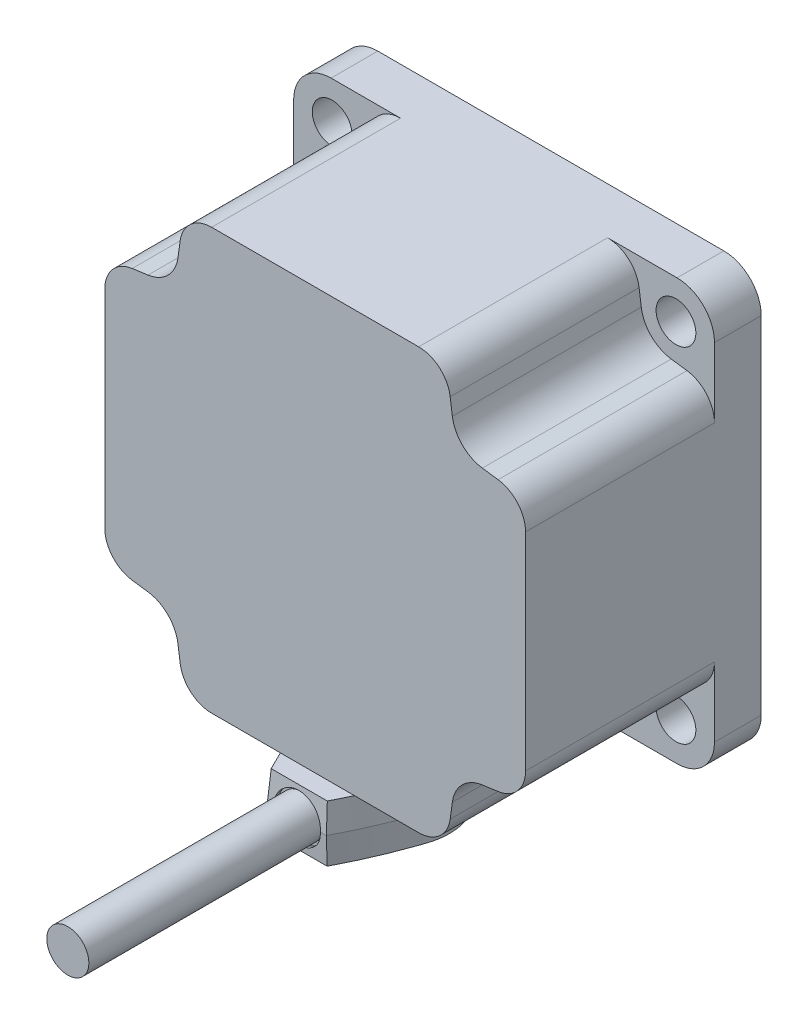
ISO-10303-21;
HEADER;
FILE_DESCRIPTION(('STEP AP214'),'2;1');
FILE_NAME('part.step','',(''),(''),'','','');
FILE_SCHEMA(('AUTOMOTIVE_DESIGN { 1 0 10303 214 1 1 1 1 }'));
ENDSEC;
DATA;
#1=APPLICATION_CONTEXT('core data for automotive mechanical design processes');
#2=APPLICATION_PROTOCOL_DEFINITION('international standard','automotive_design',2000,#1);
#3=PRODUCT_CONTEXT('',#1,'mechanical');
#4=PRODUCT('Part','Part','',(#3));
#5=PRODUCT_RELATED_PRODUCT_CATEGORY('part','',(#4));
#6=PRODUCT_DEFINITION_FORMATION('','',#4);
#7=PRODUCT_DEFINITION_CONTEXT('part definition',#1,'design');
#8=PRODUCT_DEFINITION('design','',#6,#7);
#9=PRODUCT_DEFINITION_SHAPE('','',#8);
#10=(LENGTH_UNIT() NAMED_UNIT(*) SI_UNIT(.MILLI.,.METRE.));
#11=(NAMED_UNIT(*) PLANE_ANGLE_UNIT() SI_UNIT($,.RADIAN.));
#12=(NAMED_UNIT(*) SI_UNIT($,.STERADIAN.) SOLID_ANGLE_UNIT());
#13=UNCERTAINTY_MEASURE_WITH_UNIT(LENGTH_MEASURE(1.E-05),#10,'distance_accuracy_value','');
#14=(GEOMETRIC_REPRESENTATION_CONTEXT(3) GLOBAL_UNCERTAINTY_ASSIGNED_CONTEXT((#13)) GLOBAL_UNIT_ASSIGNED_CONTEXT((#10,
#11,#12)) REPRESENTATION_CONTEXT('',''));
#15=CARTESIAN_POINT('',(0.,0.,0.));
#16=DIRECTION('',(0.,0.,1.));
#17=DIRECTION('',(1.,0.,0.));
#18=AXIS2_PLACEMENT_3D('',#15,#16,#17);
#19=CARTESIAN_POINT('',(0.,0.,-21.));
#20=DIRECTION('',(0.,0.,-1.));
#21=DIRECTION('',(0.,-1.,0.));
#22=AXIS2_PLACEMENT_3D('',#19,#20,#21);
#23=PLANE('',#22);
#24=CARTESIAN_POINT('',(0.,0.,-21.));
#25=DIRECTION('',(0.,0.,1.));
#26=DIRECTION('',(-1.,0.,0.));
#27=AXIS2_PLACEMENT_3D('',#24,#25,#26);
#28=CIRCLE('',#27,3.81);
#29=CARTESIAN_POINT('',(-3.81,0.,-21.));
#30=VERTEX_POINT('',#29);
#31=EDGE_CURVE('E657',#30,#30,#28,.T.);
#32=ORIENTED_EDGE('',*,*,#31,.F.);
#33=EDGE_LOOP('',(#32));
#34=FACE_BOUND('',#33,.T.);
#35=ADVANCED_FACE('F16',(#34),#23,.T.);
#36=CARTESIAN_POINT('',(0.,0.,-2.));
#37=DIRECTION('',(0.,0.,-1.));
#38=DIRECTION('',(0.,-1.,0.));
#39=AXIS2_PLACEMENT_3D('',#36,#37,#38);
#40=PLANE('',#39);
#41=CARTESIAN_POINT('',(0.,0.,-2.00000000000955));
#42=DIRECTION('',(0.,0.,1.));
#43=DIRECTION('',(1.,0.,0.));
#44=AXIS2_PLACEMENT_3D('',#41,#42,#43);
#45=CIRCLE('',#44,5.09823529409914);
#46=CARTESIAN_POINT('',(5.09823529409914,0.,-2.00000000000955));
#47=VERTEX_POINT('',#46);
#48=EDGE_CURVE('E812',#47,#47,#45,.T.);
#49=ORIENTED_EDGE('',*,*,#48,.T.);
#50=EDGE_LOOP('',(#49));
#51=FACE_BOUND('',#50,.T.);
#52=CARTESIAN_POINT('',(0.,0.,-2.00000000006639));
#53=DIRECTION('',(0.,0.,-1.));
#54=DIRECTION('',(1.,0.,0.));
#55=AXIS2_PLACEMENT_3D('',#52,#53,#54);
#56=CIRCLE('',#55,5.55576923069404);
#57=CARTESIAN_POINT('',(5.55576923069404,0.,-2.00000000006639));
#58=VERTEX_POINT('',#57);
#59=EDGE_CURVE('E813',#58,#58,#56,.T.);
#60=ORIENTED_EDGE('',*,*,#59,.T.);
#61=EDGE_LOOP('',(#60));
#62=FACE_BOUND('',#61,.T.);
#63=ADVANCED_FACE('F1432',(#51,#62),#40,.T.);
#64=CARTESIAN_POINT('',(0.,5.2,-13.));
#65=DIRECTION('',(0.,0.,1.));
#66=DIRECTION('',(1.,0.,0.));
#67=AXIS2_PLACEMENT_3D('',#64,#65,#66);
#68=PLANE('',#67);
#69=CARTESIAN_POINT('',(0.,0.,-13.));
#70=DIRECTION('',(0.,0.,-1.));
#71=DIRECTION('',(1.,0.,0.));
#72=AXIS2_PLACEMENT_3D('',#69,#70,#71);
#73=CIRCLE('',#72,3.9);
#74=CARTESIAN_POINT('',(-3.9,0.,-13.));
#75=VERTEX_POINT('',#74);
#76=EDGE_CURVE('E20',#75,#75,#73,.T.);
#77=ORIENTED_EDGE('',*,*,#76,.F.);
#78=EDGE_LOOP('',(#77));
#79=FACE_BOUND('',#78,.T.);
#80=CARTESIAN_POINT('',(0.,0.,-13.));
#81=DIRECTION('',(0.,0.,1.));
#82=DIRECTION('',(1.,0.,0.));
#83=AXIS2_PLACEMENT_3D('',#80,#81,#82);
#84=CIRCLE('',#83,5.2);
#85=CARTESIAN_POINT('',(-5.2,0.,-13.));
#86=VERTEX_POINT('',#85);
#87=EDGE_CURVE('E627',#86,#86,#84,.T.);
#88=ORIENTED_EDGE('',*,*,#87,.F.);
#89=EDGE_LOOP('',(#88));
#90=FACE_BOUND('',#89,.T.);
#91=ADVANCED_FACE('F1539',(#79,#90),#68,.F.);
#92=CARTESIAN_POINT('',(0.,-51.5,103.3));
#93=DIRECTION('',(0.,0.,1.));
#94=DIRECTION('',(1.,0.,0.));
#95=AXIS2_PLACEMENT_3D('',#92,#93,#94);
#96=PLANE('',#95);
#97=CARTESIAN_POINT('',(0.,-51.5,103.3));
#98=DIRECTION('',(0.,0.,-1.));
#99=DIRECTION('',(-1.,0.,0.));
#100=AXIS2_PLACEMENT_3D('',#97,#98,#99);
#101=CIRCLE('',#100,4.5);
#102=CARTESIAN_POINT('',(4.5,-51.5,103.3));
#103=VERTEX_POINT('',#102);
#104=EDGE_CURVE('E628',#103,#103,#101,.T.);
#105=ORIENTED_EDGE('',*,*,#104,.F.);
#106=EDGE_LOOP('',(#105));
#107=FACE_BOUND('',#106,.T.);
#108=ADVANCED_FACE('F1707',(#107),#96,.T.);
#109=CARTESIAN_POINT('',(82.5538001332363,-59.,7.34330530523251));
#110=DIRECTION('',(0.,-1.,0.));
#111=DIRECTION('',(0.,0.,-1.));
#112=AXIS2_PLACEMENT_3D('',#109,#110,#111);
#113=PLANE('',#112);
#114=CARTESIAN_POINT('',(0.,-59.,34.8));
#115=DIRECTION('',(0.,1.,0.));
#116=DIRECTION('',(-1.,0.,0.));
#117=AXIS2_PLACEMENT_3D('',#114,#115,#116);
#118=CIRCLE('',#117,9.5);
#119=CARTESIAN_POINT('',(9.5,-59.,34.8));
#120=VERTEX_POINT('',#119);
#121=EDGE_CURVE('E780',#120,#120,#118,.T.);
#122=ORIENTED_EDGE('',*,*,#121,.F.);
#123=EDGE_LOOP('',(#122));
#124=FACE_BOUND('',#123,.T.);
#125=ADVANCED_FACE('F1705',(#124),#113,.T.);
#126=CARTESIAN_POINT('',(0.,-51.5,53.3));
#127=DIRECTION('',(0.,0.,-1.));
#128=DIRECTION('',(0.,-1.,0.));
#129=AXIS2_PLACEMENT_3D('',#126,#127,#128);
#130=PLANE('',#129);
#131=CARTESIAN_POINT('',(0.,-51.5,53.3));
#132=DIRECTION('',(0.,0.,1.));
#133=DIRECTION('',(-1.,0.,0.));
#134=AXIS2_PLACEMENT_3D('',#131,#132,#133);
#135=CIRCLE('',#134,4.5);
#136=CARTESIAN_POINT('',(-4.5,-51.5,53.3));
#137=VERTEX_POINT('',#136);
#138=EDGE_CURVE('E622',#137,#137,#135,.T.);
#139=ORIENTED_EDGE('',*,*,#138,.F.);
#140=EDGE_LOOP('',(#139));
#141=FACE_BOUND('',#140,.T.);
#142=CARTESIAN_POINT('',(0.,-51.5,53.3));
#143=DIRECTION('',(0.,0.,1.));
#144=DIRECTION('',(1.,0.,0.));
#145=AXIS2_PLACEMENT_3D('',#142,#143,#144);
#146=CIRCLE('',#145,5.);
#147=CARTESIAN_POINT('',(5.,-51.5,53.3));
#148=VERTEX_POINT('',#147);
#149=EDGE_CURVE('E537',#148,#148,#146,.T.);
#150=ORIENTED_EDGE('',*,*,#149,.T.);
#151=EDGE_LOOP('',(#150));
#152=FACE_BOUND('',#151,.T.);
#153=ADVANCED_FACE('F1657',(#141,#152),#130,.F.);
#154=CARTESIAN_POINT('',(0.,-57.5,22.7019237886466));
#155=DIRECTION('',(0.,-1.,0.));
#156=DIRECTION('',(0.,0.,-1.));
#157=AXIS2_PLACEMENT_3D('',#154,#155,#156);
#158=PLANE('',#157);
#159=CARTESIAN_POINT('',(0.,-57.5,34.8));
#160=DIRECTION('',(0.,1.,0.));
#161=DIRECTION('',(-1.,0.,0.));
#162=AXIS2_PLACEMENT_3D('',#159,#160,#161);
#163=CIRCLE('',#162,12.0980762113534);
#164=CARTESIAN_POINT('',(-12.0980762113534,-57.5,34.8));
#165=VERTEX_POINT('',#164);
#166=EDGE_CURVE('E818',#165,#165,#163,.T.);
#167=ORIENTED_EDGE('',*,*,#166,.T.);
#168=EDGE_LOOP('',(#167));
#169=FACE_BOUND('',#168,.T.);
#170=DIRECTION('',(1.,0.,0.));
#171=VECTOR('',#170,1.);
#172=CARTESIAN_POINT('',(-6.,-57.5,53.9));
#173=LINE('',#172,#171);
#174=CARTESIAN_POINT('',(-6.06036129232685,-57.5,53.9));
#175=VERTEX_POINT('',#174);
#176=CARTESIAN_POINT('',(6.06036129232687,-57.5,53.9));
#177=VERTEX_POINT('',#176);
#178=EDGE_CURVE('E10',#175,#177,#173,.T.);
#179=ORIENTED_EDGE('',*,*,#178,.F.);
#180=CARTESIAN_POINT('',(6.06036129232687,-57.5,53.9));
#181=CARTESIAN_POINT('',(6.69147616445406,-57.5,52.6987871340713));
#182=CARTESIAN_POINT('',(7.90584065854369,-57.5,50.2687514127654));
#183=CARTESIAN_POINT('',(9.57813798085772,-57.5,46.5510550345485));
#184=CARTESIAN_POINT('',(11.0964886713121,-57.5,42.7714451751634));
#185=CARTESIAN_POINT('',(12.0036387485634,-57.5,40.2177681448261));
#186=CARTESIAN_POINT('',(12.7567529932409,-57.5,37.9533862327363));
#187=CARTESIAN_POINT('',(13.17558984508,-57.5,35.9146943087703));
#188=CARTESIAN_POINT('',(13.0704406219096,-57.5,32.7945736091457));
#189=CARTESIAN_POINT('',(12.374336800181,-57.5,30.2897578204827));
#190=CARTESIAN_POINT('',(11.478958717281,-57.5,28.4242799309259));
#191=CARTESIAN_POINT('',(10.3704413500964,-57.5,26.6775784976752));
#192=CARTESIAN_POINT('',(8.60868518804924,-57.5,24.7665744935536));
#193=CARTESIAN_POINT('',(6.02159577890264,-57.5,23.0256515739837));
#194=CARTESIAN_POINT('',(3.09594370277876,-57.5,21.9470407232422));
#195=CARTESIAN_POINT('',(0.,-57.5,21.575386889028));
#196=CARTESIAN_POINT('',(-3.09594370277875,-57.5,21.9470407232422));
#197=CARTESIAN_POINT('',(-6.02159577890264,-57.5,23.0256515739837));
#198=CARTESIAN_POINT('',(-8.60868518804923,-57.5,24.7665744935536));
#199=CARTESIAN_POINT('',(-10.3704413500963,-57.5,26.6775784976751));
#200=CARTESIAN_POINT('',(-11.4789587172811,-57.5,28.4242799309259));
#201=CARTESIAN_POINT('',(-12.374336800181,-57.5,30.2897578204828));
#202=CARTESIAN_POINT('',(-13.0704406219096,-57.5,32.7945736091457));
#203=CARTESIAN_POINT('',(-13.17558984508,-57.5,35.9146943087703));
#204=CARTESIAN_POINT('',(-12.7567529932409,-57.5,37.9533862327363));
#205=CARTESIAN_POINT('',(-12.0036387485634,-57.5,40.2177681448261));
#206=CARTESIAN_POINT('',(-11.0964886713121,-57.5,42.7714451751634));
#207=CARTESIAN_POINT('',(-9.57813798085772,-57.5,46.5510550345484));
#208=CARTESIAN_POINT('',(-7.90584065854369,-57.5,50.2687514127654));
#209=CARTESIAN_POINT('',(-6.69147616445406,-57.5,52.6987871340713));
#210=CARTESIAN_POINT('',(-6.06036129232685,-57.5,53.9));
#211=(BOUNDED_CURVE() B_SPLINE_CURVE(3,(#180,#181,#182,#183,#184,#185,#186,#187,#188,#189,#190,
#191,#192,#193,#194,#195,#196,#197,#198,#199,#200,#201,#202,#203,#204,#205,#206,#207,#208,#209,
#210),.UNSPECIFIED.,.F.,.F.) B_SPLINE_CURVE_WITH_KNOTS((4,1,1,1,2,1,1,1,1,1,1,1,1,1,1,1,1,1,1,1,
1,1,2,1,1,1,4),(0.,0.00405062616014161,0.00810125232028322,0.0121518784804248,
0.0162025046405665,0.0192981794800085,0.0223938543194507,0.0254895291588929,0.0270373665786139,
0.028585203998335,0.0316808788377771,0.0347765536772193,0.0378722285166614,0.0409679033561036,
0.0440635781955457,0.0471592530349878,0.05025492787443,0.0533506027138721,0.0548984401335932,
0.0564462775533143,0.0595419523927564,0.0626376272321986,0.0657333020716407,0.0697839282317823,
0.0738345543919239,0.0778851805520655,0.0819358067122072),
.UNSPECIFIED.) CURVE() GEOMETRIC_REPRESENTATION_ITEM() RATIONAL_B_SPLINE_CURVE((1.,1.,1.,1.,1.,
1.,1.,1.,1.,1.,1.,1.,1.,1.,1.,1.,1.,1.,1.,1.,1.,1.,1.,1.,1.,1.,1.,1.,1.,1.,1.)) REPRESENTATION_ITEM(''));
#212=EDGE_CURVE('E601',#177,#175,#211,.T.);
#213=ORIENTED_EDGE('',*,*,#212,.F.);
#214=EDGE_LOOP('',(#179,#213));
#215=FACE_BOUND('',#214,.T.);
#216=ADVANCED_FACE('F1591',(#169,#215),#158,.T.);
#217=CARTESIAN_POINT('',(-6.,-59.,53.8));
#218=DIRECTION('',(0.,-0.066519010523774,0.997785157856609));
#219=DIRECTION('',(-1.,0.,0.));
#220=AXIS2_PLACEMENT_3D('',#217,#218,#219);
#221=PLANE('',#220);
#222=ORIENTED_EDGE('',*,*,#178,.T.);
#223=DIRECTION('',(-0.0401194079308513,-0.99698183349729,-0.0664654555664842));
#224=VECTOR('',#223,1.);
#225=CARTESIAN_POINT('',(6.15090323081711,-55.25,54.05));
#226=LINE('',#225,#224);
#227=CARTESIAN_POINT('',(6.30180646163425,-51.5000000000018,54.3));
#228=VERTEX_POINT('',#227);
#229=EDGE_CURVE('E610',#228,#177,#226,.T.);
#230=ORIENTED_EDGE('',*,*,#229,.F.);
#231=DIRECTION('',(-1.,0.,0.));
#232=VECTOR('',#231,1.);
#233=CARTESIAN_POINT('',(-6.,-51.5,54.3));
#234=LINE('',#233,#232);
#235=CARTESIAN_POINT('',(5.,-51.5,54.3));
#236=VERTEX_POINT('',#235);
#237=EDGE_CURVE('E793',#228,#236,#234,.T.);
#238=ORIENTED_EDGE('',*,*,#237,.T.);
#239=CARTESIAN_POINT('',(5.,-51.5,54.3));
#240=CARTESIAN_POINT('',(4.99999999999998,-61.5,53.6333333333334));
#241=CARTESIAN_POINT('',(-5.00000000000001,-61.5,53.6333333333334));
#242=CARTESIAN_POINT('',(-5.,-51.5,54.3));
#243=(BOUNDED_CURVE() B_SPLINE_CURVE(3,(#239,#240,#241,#242),.UNSPECIFIED.,.F.,
.F.) B_SPLINE_CURVE_WITH_KNOTS((4,4),(1.5707963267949,4.71238898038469),
.UNSPECIFIED.) CURVE() GEOMETRIC_REPRESENTATION_ITEM() RATIONAL_B_SPLINE_CURVE((1.,
0.333333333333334,0.333333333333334,1.)) REPRESENTATION_ITEM(''));
#244=CARTESIAN_POINT('',(-5.,-51.5,54.3));
#245=VERTEX_POINT('',#244);
#246=EDGE_CURVE('E535',#236,#245,#243,.T.);
#247=ORIENTED_EDGE('',*,*,#246,.T.);
#248=DIRECTION('',(-1.,0.,0.));
#249=VECTOR('',#248,1.);
#250=CARTESIAN_POINT('',(-6.,-51.5,54.3));
#251=LINE('',#250,#249);
#252=CARTESIAN_POINT('',(-6.30180646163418,-51.5,54.3));
#253=VERTEX_POINT('',#252);
#254=EDGE_CURVE('E701',#245,#253,#251,.T.);
#255=ORIENTED_EDGE('',*,*,#254,.T.);
#256=DIRECTION('',(-0.0401194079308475,0.996981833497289,0.0664654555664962));
#257=VECTOR('',#256,1.);
#258=CARTESIAN_POINT('',(-6.1509032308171,-55.25,54.05));
#259=LINE('',#258,#257);
#260=EDGE_CURVE('E30',#175,#253,#259,.T.);
#261=ORIENTED_EDGE('',*,*,#260,.F.);
#262=EDGE_LOOP('',(#222,#230,#238,#247,#255,#261));
#263=FACE_BOUND('',#262,.T.);
#264=ADVANCED_FACE('F960',(#263),#221,.T.);
#265=CARTESIAN_POINT('',(0.,0.,-2.));
#266=DIRECTION('',(0.,0.,-1.));
#267=DIRECTION('',(0.,-1.,0.));
#268=AXIS2_PLACEMENT_3D('',#265,#266,#267);
#269=PLANE('',#268);
#270=CARTESIAN_POINT('',(0.,0.,-1.9999999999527));
#271=DIRECTION('',(0.,0.,1.));
#272=DIRECTION('',(1.,0.,0.));
#273=AXIS2_PLACEMENT_3D('',#270,#271,#272);
#274=CIRCLE('',#273,6.41854307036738);
#275=CARTESIAN_POINT('',(6.41854307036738,0.,-1.9999999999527));
#276=VERTEX_POINT('',#275);
#277=EDGE_CURVE('E618',#276,#276,#274,.T.);
#278=ORIENTED_EDGE('',*,*,#277,.T.);
#279=EDGE_LOOP('',(#278));
#280=FACE_BOUND('',#279,.T.);
#281=CARTESIAN_POINT('',(0.,0.,-2.));
#282=DIRECTION('',(0.,0.,1.));
#283=DIRECTION('',(-1.,0.,0.));
#284=AXIS2_PLACEMENT_3D('',#281,#282,#283);
#285=CIRCLE('',#284,41.5);
#286=CARTESIAN_POINT('',(-41.5,0.,-2.));
#287=VERTEX_POINT('',#286);
#288=EDGE_CURVE('E652',#287,#287,#285,.T.);
#289=ORIENTED_EDGE('',*,*,#288,.F.);
#290=EDGE_LOOP('',(#289));
#291=FACE_BOUND('',#290,.T.);
#292=ADVANCED_FACE('F1497',(#280,#291),#269,.T.);
#293=CARTESIAN_POINT('',(6.06032114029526,-57.5009977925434,53.8999334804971));
#294=CARTESIAN_POINT('',(6.30180646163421,-51.5,54.3));
#295=CARTESIAN_POINT('',(6.69143354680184,-57.5009977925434,52.6987241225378));
#296=CARTESIAN_POINT('',(6.94774778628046,-51.5,53.0776927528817));
#297=CARTESIAN_POINT('',(7.90579382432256,-57.5009977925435,50.2686947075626));
#298=CARTESIAN_POINT('',(8.18746766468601,-51.5,50.6097353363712));
#299=CARTESIAN_POINT('',(9.57808579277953,-57.5009977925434,46.5510074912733));
#300=CARTESIAN_POINT('',(9.89195919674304,-51.5,46.8369457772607));
#301=CARTESIAN_POINT('',(11.0964312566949,-57.5009977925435,42.7714084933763));
#302=CARTESIAN_POINT('',(11.441738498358,-51.5,42.9920228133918));
#303=CARTESIAN_POINT('',(12.0035775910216,-57.5009977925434,40.2177412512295));
#304=CARTESIAN_POINT('',(12.3713958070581,-51.5,40.37948671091));
#305=CARTESIAN_POINT('',(12.7566883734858,-57.5009977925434,37.9533697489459));
#306=CARTESIAN_POINT('',(13.145329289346,-51.5,38.0525077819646));
#307=CARTESIAN_POINT('',(13.175523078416,-57.5009977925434,35.9146873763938));
#308=CARTESIAN_POINT('',(13.5770760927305,-51.5,35.95638058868));
#309=CARTESIAN_POINT('',(13.0703740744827,-57.5009977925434,32.7945816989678));
#310=CARTESIAN_POINT('',(13.4706085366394,-51.5,32.7459272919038));
#311=CARTESIAN_POINT('',(12.37427306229,-57.5009977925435,30.289778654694));
#312=CARTESIAN_POINT('',(12.7576102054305,-51.5,30.1644759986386));
#313=CARTESIAN_POINT('',(11.4788993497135,-57.5009977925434,28.4243102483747));
#314=CARTESIAN_POINT('',(11.8359521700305,-51.5,28.2419728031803));
#315=CARTESIAN_POINT('',(10.3703874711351,-57.5009977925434,26.6776178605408));
#316=CARTESIAN_POINT('',(10.6944303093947,-51.5,26.4408787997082));
#317=CARTESIAN_POINT('',(8.60863968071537,-57.5009977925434,24.7666244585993));
#318=CARTESIAN_POINT('',(8.88233325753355,-51.5,24.4661209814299));
#319=CARTESIAN_POINT('',(6.021564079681,-57.5009977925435,23.0257104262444));
#320=CARTESIAN_POINT('',(6.21221188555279,-51.5,22.6717568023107));
#321=CARTESIAN_POINT('',(3.09592717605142,-57.5009977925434,21.9471062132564));
#322=CARTESIAN_POINT('',(3.19532344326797,-51.5,21.5532313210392));
#323=CARTESIAN_POINT('',(0.,-57.5009977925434,21.5754537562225));
#324=CARTESIAN_POINT('',(0.,-51.5,21.173296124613));
#325=CARTESIAN_POINT('',(-3.09592717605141,-57.5009977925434,21.9471062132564));
#326=CARTESIAN_POINT('',(-3.19532344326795,-51.5,21.5532313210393));
#327=CARTESIAN_POINT('',(-6.02156407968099,-57.5009977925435,23.0257104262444));
#328=CARTESIAN_POINT('',(-6.21221188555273,-51.5,22.6717568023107));
#329=CARTESIAN_POINT('',(-8.60863968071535,-57.5009977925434,24.7666244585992));
#330=CARTESIAN_POINT('',(-8.88233325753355,-51.5,24.4661209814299));
#331=CARTESIAN_POINT('',(-10.370387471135,-57.5009977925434,26.6776178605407));
#332=CARTESIAN_POINT('',(-10.6944303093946,-51.5,26.4408787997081));
#333=CARTESIAN_POINT('',(-11.4788993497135,-57.5009977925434,28.4243102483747));
#334=CARTESIAN_POINT('',(-11.8359521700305,-51.5,28.2419728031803));
#335=CARTESIAN_POINT('',(-12.37427306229,-57.5009977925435,30.289778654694));
#336=CARTESIAN_POINT('',(-12.7576102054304,-51.5,30.1644759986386));
#337=CARTESIAN_POINT('',(-13.0703740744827,-57.5009977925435,32.7945816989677));
#338=CARTESIAN_POINT('',(-13.4706085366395,-51.5,32.7459272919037));
#339=CARTESIAN_POINT('',(-13.175523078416,-57.5009977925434,35.9146873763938));
#340=CARTESIAN_POINT('',(-13.5770760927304,-51.5,35.95638058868));
#341=CARTESIAN_POINT('',(-12.7566883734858,-57.5009977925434,37.9533697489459));
#342=CARTESIAN_POINT('',(-13.145329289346,-51.5,38.0525077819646));
#343=CARTESIAN_POINT('',(-12.0035775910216,-57.5009977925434,40.2177412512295));
#344=CARTESIAN_POINT('',(-12.3713958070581,-51.5,40.3794867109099));
#345=CARTESIAN_POINT('',(-11.0964312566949,-57.5009977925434,42.7714084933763));
#346=CARTESIAN_POINT('',(-11.4417384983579,-51.5,42.9920228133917));
#347=CARTESIAN_POINT('',(-9.57808579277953,-57.5009977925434,46.5510074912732));
#348=CARTESIAN_POINT('',(-9.89195919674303,-51.5,46.8369457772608));
#349=CARTESIAN_POINT('',(-7.90579382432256,-57.5009977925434,50.2686947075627));
#350=CARTESIAN_POINT('',(-8.18746766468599,-51.5,50.6097353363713));
#351=CARTESIAN_POINT('',(-6.69143354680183,-57.5009977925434,52.6987241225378));
#352=CARTESIAN_POINT('',(-6.94774778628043,-51.5,53.0776927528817));
#353=CARTESIAN_POINT('',(-6.06032114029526,-57.5009977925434,53.8999334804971));
#354=CARTESIAN_POINT('',(-6.30180646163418,-51.5,54.3));
#355=(BOUNDED_SURFACE() B_SPLINE_SURFACE(3,1,((#293,#294),(#295,#296),(#297,#298),(#299,#300),
(#301,#302),(#303,#304),(#305,#306),(#307,#308),(#309,#310),(#311,#312),(#313,#314),(#315,#316),
(#317,#318),(#319,#320),(#321,#322),(#323,#324),(#325,#326),(#327,#328),(#329,#330),(#331,#332),
(#333,#334),(#335,#336),(#337,#338),(#339,#340),(#341,#342),(#343,#344),(#345,#346),(#347,#348),
(#349,#350),(#351,#352),(#353,#354)),.UNSPECIFIED.,.F.,.F.,.F.) B_SPLINE_SURFACE_WITH_KNOTS((4,
1,1,1,2,1,1,1,1,1,1,1,1,1,1,1,1,1,1,1,1,1,2,1,1,1,4),(2,2),(0.,0.0494365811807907,
0.0988731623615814,0.148309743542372,0.197746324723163,0.235528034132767,0.273309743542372,
0.311091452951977,0.329982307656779,0.348873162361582,0.386654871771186,0.42443658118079,
0.462218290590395,0.5,0.537781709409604,0.575563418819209,0.613345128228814,0.651126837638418,
0.670017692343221,0.688908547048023,0.726690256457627,0.764471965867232,0.802253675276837,
0.851690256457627,0.901126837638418,0.950563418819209,1.),(0.199866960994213,1.),
.UNSPECIFIED.) GEOMETRIC_REPRESENTATION_ITEM() RATIONAL_B_SPLINE_SURFACE(((1.,1.),(1.,1.),(1.,
1.),(1.,1.),(1.,1.),(1.,1.),(1.,1.),(1.,1.),(1.,1.),(1.,1.),(1.,1.),(1.,1.),(1.,1.),(1.,1.),(1.,
1.),(1.,1.),(1.,1.),(1.,1.),(1.,1.),(1.,1.),(1.,1.),(1.,1.),(1.,1.),(1.,1.),(1.,1.),(1.,1.),(1.,
1.),(1.,1.),(1.,1.),(1.,1.),(1.,1.))) REPRESENTATION_ITEM('') SURFACE());
#356=CARTESIAN_POINT('',(6.30180646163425,-51.5000000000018,54.3));
#357=CARTESIAN_POINT('',(6.94774778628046,-51.5,53.0776927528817));
#358=CARTESIAN_POINT('',(8.187467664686,-51.5,50.6097353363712));
#359=CARTESIAN_POINT('',(9.89195919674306,-51.5,46.8369457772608));
#360=CARTESIAN_POINT('',(11.4417384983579,-51.5,42.9920228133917));
#361=CARTESIAN_POINT('',(12.3713958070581,-51.5,40.37948671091));
#362=CARTESIAN_POINT('',(13.145329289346,-51.5,38.0525077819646));
#363=CARTESIAN_POINT('',(13.5770760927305,-51.5,35.9563805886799));
#364=CARTESIAN_POINT('',(13.4706085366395,-51.5,32.7459272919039));
#365=CARTESIAN_POINT('',(12.7576102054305,-51.5,30.1644759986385));
#366=CARTESIAN_POINT('',(11.8359521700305,-51.5,28.2419728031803));
#367=CARTESIAN_POINT('',(10.6944303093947,-51.5,26.4408787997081));
#368=CARTESIAN_POINT('',(8.88233325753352,-51.5,24.46612098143));
#369=CARTESIAN_POINT('',(6.21221188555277,-51.5,22.6717568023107));
#370=CARTESIAN_POINT('',(3.19532344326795,-51.5,21.5532313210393));
#371=CARTESIAN_POINT('',(0.,-51.5,21.1732961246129));
#372=CARTESIAN_POINT('',(-3.19532344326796,-51.5,21.5532313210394));
#373=CARTESIAN_POINT('',(-6.21221188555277,-51.5,22.6717568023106));
#374=CARTESIAN_POINT('',(-8.88233325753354,-51.5,24.46612098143));
#375=CARTESIAN_POINT('',(-10.6944303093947,-51.5,26.440878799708));
#376=CARTESIAN_POINT('',(-11.8359521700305,-51.5,28.2419728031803));
#377=CARTESIAN_POINT('',(-12.7576102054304,-51.5,30.1644759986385));
#378=CARTESIAN_POINT('',(-13.4706085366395,-51.5,32.7459272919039));
#379=CARTESIAN_POINT('',(-13.5770760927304,-51.5,35.95638058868));
#380=CARTESIAN_POINT('',(-13.1453292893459,-51.5,38.0525077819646));
#381=CARTESIAN_POINT('',(-12.3713958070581,-51.5,40.37948671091));
#382=CARTESIAN_POINT('',(-11.441738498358,-51.5,42.9920228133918));
#383=CARTESIAN_POINT('',(-9.89195919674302,-51.5,46.8369457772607));
#384=CARTESIAN_POINT('',(-8.187467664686,-51.5,50.6097353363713));
#385=CARTESIAN_POINT('',(-6.94774778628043,-51.5,53.0776927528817));
#386=CARTESIAN_POINT('',(-6.30180646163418,-51.5,54.3));
#387=(BOUNDED_CURVE() B_SPLINE_CURVE(3,(#356,#357,#358,#359,#360,#361,#362,#363,#364,#365,#366,
#367,#368,#369,#370,#371,#372,#373,#374,#375,#376,#377,#378,#379,#380,#381,#382,#383,#384,#385,
#386),.UNSPECIFIED.,.F.,.F.) B_SPLINE_CURVE_WITH_KNOTS((4,1,1,1,2,1,1,1,1,1,1,1,1,1,1,1,1,1,1,1,
1,1,2,1,1,1,4),(0.,0.0494365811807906,0.0988731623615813,0.148309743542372,0.197746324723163,
0.235528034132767,0.273309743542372,0.311091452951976,0.329982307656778,0.348873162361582,
0.386654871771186,0.42443658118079,0.462218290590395,0.5,0.537781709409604,0.575563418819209,
0.613345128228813,0.651126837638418,0.67001769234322,0.688908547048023,0.726690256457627,
0.764471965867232,0.802253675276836,0.851690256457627,0.901126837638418,0.950563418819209,1.),
.UNSPECIFIED.) CURVE() GEOMETRIC_REPRESENTATION_ITEM() RATIONAL_B_SPLINE_CURVE((1.,1.,1.,1.,1.,
1.,1.,1.,1.,1.,1.,1.,1.,1.,1.,1.,1.,1.,1.,1.,1.,1.,1.,1.,1.,1.,1.,1.,1.,1.,1.)) REPRESENTATION_ITEM(''));
#388=EDGE_CURVE('E472',#228,#253,#387,.T.);
#389=ORIENTED_EDGE('',*,*,#388,.F.);
#390=ORIENTED_EDGE('',*,*,#229,.T.);
#391=ORIENTED_EDGE('',*,*,#212,.T.);
#392=ORIENTED_EDGE('',*,*,#260,.T.);
#393=EDGE_LOOP('',(#389,#390,#391,#392));
#394=FACE_BOUND('',#393,.T.);
#395=ADVANCED_FACE('F952',(#394),#355,.T.);
#396=CARTESIAN_POINT('',(38.2,22.14,10.));
#397=DIRECTION('',(0.,0.,1.));
#398=DIRECTION('',(1.,0.,0.));
#399=AXIS2_PLACEMENT_3D('',#396,#397,#398);
#400=PLANE('',#399);
#401=CARTESIAN_POINT('',(36.7695526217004,36.7695526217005,10.));
#402=DIRECTION('',(0.,0.,-1.));
#403=DIRECTION('',(-1.,0.,0.));
#404=AXIS2_PLACEMENT_3D('',#401,#402,#403);
#405=CIRCLE('',#404,4.25);
#406=CARTESIAN_POINT('',(32.5195526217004,36.7695526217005,10.));
#407=VERTEX_POINT('',#406);
#408=EDGE_CURVE('E677',#407,#407,#405,.T.);
#409=ORIENTED_EDGE('',*,*,#408,.T.);
#410=EDGE_LOOP('',(#409));
#411=FACE_BOUND('',#410,.T.);
#412=DIRECTION('',(0.,1.,0.));
#413=VECTOR('',#412,1.);
#414=CARTESIAN_POINT('',(45.,45.,10.));
#415=LINE('',#414,#413);
#416=CARTESIAN_POINT('',(45.,22.14,10.));
#417=VERTEX_POINT('',#416);
#418=CARTESIAN_POINT('',(45.,37.,10.));
#419=VERTEX_POINT('',#418);
#420=EDGE_CURVE('E872',#417,#419,#415,.T.);
#421=ORIENTED_EDGE('',*,*,#420,.T.);
#422=CARTESIAN_POINT('',(37.,37.,10.));
#423=DIRECTION('',(0.,0.,-1.));
#424=DIRECTION('',(-1.,0.,0.));
#425=AXIS2_PLACEMENT_3D('',#422,#423,#424);
#426=CIRCLE('',#425,8.);
#427=CARTESIAN_POINT('',(37.,45.,10.));
#428=VERTEX_POINT('',#427);
#429=EDGE_CURVE('E792',#428,#419,#426,.T.);
#430=ORIENTED_EDGE('',*,*,#429,.F.);
#431=DIRECTION('',(-1.,0.,0.));
#432=VECTOR('',#431,1.);
#433=CARTESIAN_POINT('',(-45.,45.,10.));
#434=LINE('',#433,#432);
#435=CARTESIAN_POINT('',(22.14,45.,10.));
#436=VERTEX_POINT('',#435);
#437=EDGE_CURVE('E835',#428,#436,#434,.T.);
#438=ORIENTED_EDGE('',*,*,#437,.T.);
#439=CARTESIAN_POINT('',(22.14,38.2,10.));
#440=DIRECTION('',(0.,0.,1.));
#441=DIRECTION('',(-1.,0.,0.));
#442=AXIS2_PLACEMENT_3D('',#439,#440,#441);
#443=CIRCLE('',#442,6.8);
#444=CARTESIAN_POINT('',(28.8769313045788,39.1239895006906,10.));
#445=VERTEX_POINT('',#444);
#446=EDGE_CURVE('E470',#445,#436,#443,.T.);
#447=ORIENTED_EDGE('',*,*,#446,.F.);
#448=DIRECTION('',(-0.135880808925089,0.99072519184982,0.));
#449=VECTOR('',#448,1.);
#450=CARTESIAN_POINT('',(28.8769313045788,39.1239895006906,10.));
#451=LINE('',#450,#449);
#452=CARTESIAN_POINT('',(29.3395610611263,35.7508939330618,10.));
#453=VERTEX_POINT('',#452);
#454=EDGE_CURVE('E561',#453,#445,#451,.T.);
#455=ORIENTED_EDGE('',*,*,#454,.F.);
#456=CARTESIAN_POINT('',(36.77,36.77,10.));
#457=DIRECTION('',(0.,0.,1.));
#458=DIRECTION('',(-1.,0.,0.));
#459=AXIS2_PLACEMENT_3D('',#456,#457,#458);
#460=CIRCLE('',#459,7.5);
#461=CARTESIAN_POINT('',(35.7508939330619,29.3395610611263,10.));
#462=VERTEX_POINT('',#461);
#463=EDGE_CURVE('E539',#453,#462,#460,.T.);
#464=ORIENTED_EDGE('',*,*,#463,.T.);
#465=DIRECTION('',(-0.990725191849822,0.135880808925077,0.));
#466=VECTOR('',#465,1.);
#467=CARTESIAN_POINT('',(35.7508939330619,29.3395610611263,10.));
#468=LINE('',#467,#466);
#469=CARTESIAN_POINT('',(39.1239895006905,28.8769313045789,10.));
#470=VERTEX_POINT('',#469);
#471=EDGE_CURVE('E550',#470,#462,#468,.T.);
#472=ORIENTED_EDGE('',*,*,#471,.F.);
#473=CARTESIAN_POINT('',(38.2,22.14,10.));
#474=DIRECTION('',(0.,0.,1.));
#475=DIRECTION('',(-1.,0.,0.));
#476=AXIS2_PLACEMENT_3D('',#473,#474,#475);
#477=CIRCLE('',#476,6.8);
#478=EDGE_CURVE('E710',#417,#470,#477,.T.);
#479=ORIENTED_EDGE('',*,*,#478,.F.);
#480=EDGE_LOOP('',(#421,#430,#438,#447,#455,#464,#472,#479));
#481=FACE_BOUND('',#480,.T.);
#482=ADVANCED_FACE('F1495',(#411,#481),#400,.T.);
#483=CARTESIAN_POINT('',(37.,37.,10.));
#484=DIRECTION('',(0.,0.,-1.));
#485=DIRECTION('',(-1.,0.,0.));
#486=AXIS2_PLACEMENT_3D('',#483,#484,#485);
#487=CYLINDRICAL_SURFACE('',#486,8.);
#488=CARTESIAN_POINT('',(37.,37.,0.));
#489=DIRECTION('',(0.,0.,-1.));
#490=DIRECTION('',(-1.,0.,0.));
#491=AXIS2_PLACEMENT_3D('',#488,#489,#490);
#492=CIRCLE('',#491,8.);
#493=CARTESIAN_POINT('',(37.,45.,0.));
#494=VERTEX_POINT('',#493);
#495=CARTESIAN_POINT('',(45.,37.,0.));
#496=VERTEX_POINT('',#495);
#497=EDGE_CURVE('E575',#494,#496,#492,.T.);
#498=ORIENTED_EDGE('',*,*,#497,.F.);
#499=DIRECTION('',(0.,0.,1.));
#500=VECTOR('',#499,1.);
#501=CARTESIAN_POINT('',(37.,45.,10.));
#502=LINE('',#501,#500);
#503=EDGE_CURVE('E807',#494,#428,#502,.T.);
#504=ORIENTED_EDGE('',*,*,#503,.T.);
#505=ORIENTED_EDGE('',*,*,#429,.T.);
#506=DIRECTION('',(0.,0.,-1.));
#507=VECTOR('',#506,1.);
#508=CARTESIAN_POINT('',(45.,37.,10.));
#509=LINE('',#508,#507);
#510=EDGE_CURVE('E772',#419,#496,#509,.T.);
#511=ORIENTED_EDGE('',*,*,#510,.T.);
#512=EDGE_LOOP('',(#498,#504,#505,#511));
#513=FACE_BOUND('',#512,.T.);
#514=ADVANCED_FACE('F1374',(#513),#487,.T.);
#515=CARTESIAN_POINT('',(22.14,-38.2,10.));
#516=DIRECTION('',(0.,0.,1.));
#517=DIRECTION('',(1.,0.,0.));
#518=AXIS2_PLACEMENT_3D('',#515,#516,#517);
#519=PLANE('',#518);
#520=CARTESIAN_POINT('',(36.7695526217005,-36.7695526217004,10.));
#521=DIRECTION('',(0.,0.,-1.));
#522=DIRECTION('',(-1.,0.,0.));
#523=AXIS2_PLACEMENT_3D('',#520,#521,#522);
#524=CIRCLE('',#523,4.25);
#525=CARTESIAN_POINT('',(32.5195526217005,-36.7695526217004,10.));
#526=VERTEX_POINT('',#525);
#527=EDGE_CURVE('E641',#526,#526,#524,.T.);
#528=ORIENTED_EDGE('',*,*,#527,.T.);
#529=EDGE_LOOP('',(#528));
#530=FACE_BOUND('',#529,.T.);
#531=DIRECTION('',(1.,0.,0.));
#532=VECTOR('',#531,1.);
#533=CARTESIAN_POINT('',(-45.,-45.,10.));
#534=LINE('',#533,#532);
#535=CARTESIAN_POINT('',(22.14,-45.,10.));
#536=VERTEX_POINT('',#535);
#537=CARTESIAN_POINT('',(37.,-45.,10.));
#538=VERTEX_POINT('',#537);
#539=EDGE_CURVE('E617',#536,#538,#534,.T.);
#540=ORIENTED_EDGE('',*,*,#539,.T.);
#541=CARTESIAN_POINT('',(37.,-37.,10.));
#542=DIRECTION('',(0.,0.,-1.));
#543=DIRECTION('',(-1.,0.,0.));
#544=AXIS2_PLACEMENT_3D('',#541,#542,#543);
#545=CIRCLE('',#544,8.);
#546=CARTESIAN_POINT('',(45.,-37.,10.));
#547=VERTEX_POINT('',#546);
#548=EDGE_CURVE('E789',#547,#538,#545,.T.);
#549=ORIENTED_EDGE('',*,*,#548,.F.);
#550=DIRECTION('',(0.,1.,0.));
#551=VECTOR('',#550,1.);
#552=CARTESIAN_POINT('',(45.,45.,10.));
#553=LINE('',#552,#551);
#554=CARTESIAN_POINT('',(45.,-22.14,10.));
#555=VERTEX_POINT('',#554);
#556=EDGE_CURVE('E674',#547,#555,#553,.T.);
#557=ORIENTED_EDGE('',*,*,#556,.T.);
#558=CARTESIAN_POINT('',(38.2,-22.14,10.));
#559=DIRECTION('',(0.,0.,1.));
#560=DIRECTION('',(-1.,0.,0.));
#561=AXIS2_PLACEMENT_3D('',#558,#559,#560);
#562=CIRCLE('',#561,6.8);
#563=CARTESIAN_POINT('',(39.1239895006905,-28.8769313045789,10.));
#564=VERTEX_POINT('',#563);
#565=EDGE_CURVE('E579',#564,#555,#562,.T.);
#566=ORIENTED_EDGE('',*,*,#565,.F.);
#567=DIRECTION('',(0.990725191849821,0.135880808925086,0.));
#568=VECTOR('',#567,1.);
#569=CARTESIAN_POINT('',(39.1239895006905,-28.8769313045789,10.));
#570=LINE('',#569,#568);
#571=CARTESIAN_POINT('',(35.7508939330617,-29.3395610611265,10.));
#572=VERTEX_POINT('',#571);
#573=EDGE_CURVE('E731',#572,#564,#570,.T.);
#574=ORIENTED_EDGE('',*,*,#573,.F.);
#575=CARTESIAN_POINT('',(36.77,-36.77,10.));
#576=DIRECTION('',(0.,0.,1.));
#577=DIRECTION('',(-1.,0.,0.));
#578=AXIS2_PLACEMENT_3D('',#575,#576,#577);
#579=CIRCLE('',#578,7.5);
#580=CARTESIAN_POINT('',(29.3395610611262,-35.7508939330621,10.));
#581=VERTEX_POINT('',#580);
#582=EDGE_CURVE('E745',#572,#581,#579,.T.);
#583=ORIENTED_EDGE('',*,*,#582,.T.);
#584=DIRECTION('',(0.135880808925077,0.990725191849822,0.));
#585=VECTOR('',#584,1.);
#586=CARTESIAN_POINT('',(29.3395610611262,-35.750893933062,10.));
#587=LINE('',#586,#585);
#588=CARTESIAN_POINT('',(28.8769313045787,-39.1239895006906,10.));
#589=VERTEX_POINT('',#588);
#590=EDGE_CURVE('E560',#589,#581,#587,.T.);
#591=ORIENTED_EDGE('',*,*,#590,.F.);
#592=CARTESIAN_POINT('',(22.14,-38.2,10.));
#593=DIRECTION('',(0.,0.,1.));
#594=DIRECTION('',(-1.,0.,0.));
#595=AXIS2_PLACEMENT_3D('',#592,#593,#594);
#596=CIRCLE('',#595,6.8);
#597=EDGE_CURVE('E562',#536,#589,#596,.T.);
#598=ORIENTED_EDGE('',*,*,#597,.F.);
#599=EDGE_LOOP('',(#540,#549,#557,#566,#574,#583,#591,#598));
#600=FACE_BOUND('',#599,.T.);
#601=ADVANCED_FACE('F1369',(#530,#600),#519,.T.);
#602=CARTESIAN_POINT('',(37.,-37.,10.));
#603=DIRECTION('',(0.,0.,-1.));
#604=DIRECTION('',(-1.,0.,0.));
#605=AXIS2_PLACEMENT_3D('',#602,#603,#604);
#606=CYLINDRICAL_SURFACE('',#605,8.);
#607=CARTESIAN_POINT('',(37.,-37.,0.));
#608=DIRECTION('',(0.,0.,-1.));
#609=DIRECTION('',(-1.,0.,0.));
#610=AXIS2_PLACEMENT_3D('',#607,#608,#609);
#611=CIRCLE('',#610,8.);
#612=CARTESIAN_POINT('',(45.,-37.,0.));
#613=VERTEX_POINT('',#612);
#614=CARTESIAN_POINT('',(37.,-45.,0.));
#615=VERTEX_POINT('',#614);
#616=EDGE_CURVE('E771',#613,#615,#611,.T.);
#617=ORIENTED_EDGE('',*,*,#616,.F.);
#618=DIRECTION('',(0.,0.,1.));
#619=VECTOR('',#618,1.);
#620=CARTESIAN_POINT('',(45.,-37.,10.));
#621=LINE('',#620,#619);
#622=EDGE_CURVE('E740',#613,#547,#621,.T.);
#623=ORIENTED_EDGE('',*,*,#622,.T.);
#624=ORIENTED_EDGE('',*,*,#548,.T.);
#625=DIRECTION('',(0.,0.,-1.));
#626=VECTOR('',#625,1.);
#627=CARTESIAN_POINT('',(37.,-45.,10.));
#628=LINE('',#627,#626);
#629=EDGE_CURVE('E683',#538,#615,#628,.T.);
#630=ORIENTED_EDGE('',*,*,#629,.T.);
#631=EDGE_LOOP('',(#617,#623,#624,#630));
#632=FACE_BOUND('',#631,.T.);
#633=ADVANCED_FACE('F1373',(#632),#606,.T.);
#634=CARTESIAN_POINT('',(6.,-45.5,53.8));
#635=DIRECTION('',(0.,0.0830454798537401,0.99654575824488));
#636=DIRECTION('',(1.,0.,0.));
#637=AXIS2_PLACEMENT_3D('',#634,#635,#636);
#638=PLANE('',#637);
#639=DIRECTION('',(1.,0.,0.));
#640=VECTOR('',#639,1.);
#641=CARTESIAN_POINT('',(82.5538001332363,-45.5,53.8));
#642=LINE('',#641,#640);
#643=CARTESIAN_POINT('',(-6.,-45.5,53.8));
#644=VERTEX_POINT('',#643);
#645=CARTESIAN_POINT('',(6.,-45.5,53.8));
#646=VERTEX_POINT('',#645);
#647=EDGE_CURVE('E529',#644,#646,#642,.T.);
#648=ORIENTED_EDGE('',*,*,#647,.F.);
#649=DIRECTION('',(0.0500644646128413,0.995296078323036,-0.0829413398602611));
#650=VECTOR('',#649,1.);
#651=CARTESIAN_POINT('',(-6.15090323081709,-48.5,54.05));
#652=LINE('',#651,#650);
#653=EDGE_CURVE('E476',#253,#644,#652,.T.);
#654=ORIENTED_EDGE('',*,*,#653,.F.);
#655=ORIENTED_EDGE('',*,*,#254,.F.);
#656=CARTESIAN_POINT('',(-5.,-51.5,54.3));
#657=CARTESIAN_POINT('',(-5.00000000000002,-41.5,53.4666666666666));
#658=CARTESIAN_POINT('',(4.99999999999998,-41.5,53.4666666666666));
#659=CARTESIAN_POINT('',(5.,-51.5,54.3));
#660=(BOUNDED_CURVE() B_SPLINE_CURVE(3,(#656,#657,#658,#659),.UNSPECIFIED.,.F.,
.F.) B_SPLINE_CURVE_WITH_KNOTS((4,4),(1.5707963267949,4.71238898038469),
.UNSPECIFIED.) CURVE() GEOMETRIC_REPRESENTATION_ITEM() RATIONAL_B_SPLINE_CURVE((1.,
0.333333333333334,0.333333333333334,1.)) REPRESENTATION_ITEM(''));
#661=EDGE_CURVE('E538',#245,#236,#660,.T.);
#662=ORIENTED_EDGE('',*,*,#661,.T.);
#663=ORIENTED_EDGE('',*,*,#237,.F.);
#664=DIRECTION('',(0.0500644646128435,-0.995296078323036,0.0829413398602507));
#665=VECTOR('',#664,1.);
#666=CARTESIAN_POINT('',(6.15090323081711,-48.5,54.05));
#667=LINE('',#666,#665);
#668=EDGE_CURVE('E700',#646,#228,#667,.T.);
#669=ORIENTED_EDGE('',*,*,#668,.F.);
#670=EDGE_LOOP('',(#648,#654,#655,#662,#663,#669));
#671=FACE_BOUND('',#670,.T.);
#672=ADVANCED_FACE('F964',(#671),#638,.T.);
#673=CARTESIAN_POINT('',(-6.,-45.5,53.8));
#674=CARTESIAN_POINT('',(-6.30180646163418,-51.5,54.3));
#675=CARTESIAN_POINT('',(-6.62740825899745,-45.5,52.6040607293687));
#676=CARTESIAN_POINT('',(-6.94774778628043,-51.5,53.0776927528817));
#677=CARTESIAN_POINT('',(-7.83543390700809,-45.5,50.183505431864));
#678=CARTESIAN_POINT('',(-8.187467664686,-51.5,50.6097353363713));
#679=CARTESIAN_POINT('',(-9.49968267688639,-45.5,46.4795823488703));
#680=CARTESIAN_POINT('',(-9.89195919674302,-51.5,46.8369457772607));
#681=CARTESIAN_POINT('',(-11.0101762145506,-45.5,42.7163007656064));
#682=CARTESIAN_POINT('',(-11.441738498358,-51.5,42.9920228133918));
#683=CARTESIAN_POINT('',(-11.9116994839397,-45.5,40.1773385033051));
#684=CARTESIAN_POINT('',(-12.3713958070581,-51.5,40.37948671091));
#685=CARTESIAN_POINT('',(-12.6596089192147,-45.5,37.9286058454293));
#686=CARTESIAN_POINT('',(-13.1453292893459,-51.5,38.0525077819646));
#687=CARTESIAN_POINT('',(-13.0752182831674,-45.5,35.9042727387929));
#688=CARTESIAN_POINT('',(-13.5770760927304,-51.5,35.95638058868));
#689=CARTESIAN_POINT('',(-12.9703986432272,-45.5,32.8067351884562));
#690=CARTESIAN_POINT('',(-13.4706085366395,-51.5,32.7459272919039));
#691=CARTESIAN_POINT('',(-12.2785184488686,-45.5,30.3210782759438));
#692=CARTESIAN_POINT('',(-12.7576102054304,-51.5,30.1644759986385));
#693=CARTESIAN_POINT('',(-11.3897103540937,-45.5,28.4698567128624));
#694=CARTESIAN_POINT('',(-11.8359521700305,-51.5,28.2419728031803));
#695=CARTESIAN_POINT('',(-10.2894441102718,-45.5,26.7367534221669));
#696=CARTESIAN_POINT('',(-10.6944303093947,-51.5,26.440878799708));
#697=CARTESIAN_POINT('',(-8.54027317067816,-45.5,24.8416878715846));
#698=CARTESIAN_POINT('',(-8.88233325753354,-51.5,24.46612098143));
#699=CARTESIAN_POINT('',(-5.9739417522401,-45.5,23.1141252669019));
#700=CARTESIAN_POINT('',(-6.21221188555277,-51.5,22.6717568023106));
#701=CARTESIAN_POINT('',(-3.07109876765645,-45.5,22.0454930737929));
#702=CARTESIAN_POINT('',(-3.19532344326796,-51.5,21.5532313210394));
#703=CARTESIAN_POINT('',(0.,-45.5,21.6759095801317));
#704=CARTESIAN_POINT('',(0.,-51.5,21.1732961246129));
#705=CARTESIAN_POINT('',(3.07109876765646,-45.5,22.045493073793));
#706=CARTESIAN_POINT('',(3.19532344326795,-51.5,21.5532313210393));
#707=CARTESIAN_POINT('',(5.97394175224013,-45.5,23.114125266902));
#708=CARTESIAN_POINT('',(6.21221188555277,-51.5,22.6717568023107));
#709=CARTESIAN_POINT('',(8.54027317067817,-45.5,24.8416878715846));
#710=CARTESIAN_POINT('',(8.88233325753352,-51.5,24.46612098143));
#711=CARTESIAN_POINT('',(10.2894441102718,-45.5,26.7367534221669));
#712=CARTESIAN_POINT('',(10.6944303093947,-51.5,26.4408787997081));
#713=CARTESIAN_POINT('',(11.3897103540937,-45.5,28.4698567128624));
#714=CARTESIAN_POINT('',(11.8359521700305,-51.5,28.2419728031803));
#715=CARTESIAN_POINT('',(12.2785184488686,-45.5,30.3210782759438));
#716=CARTESIAN_POINT('',(12.7576102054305,-51.5,30.1644759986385));
#717=CARTESIAN_POINT('',(12.9703986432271,-45.5,32.806735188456));
#718=CARTESIAN_POINT('',(13.4706085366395,-51.5,32.7459272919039));
#719=CARTESIAN_POINT('',(13.0752182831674,-45.5,35.9042727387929));
#720=CARTESIAN_POINT('',(13.5770760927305,-51.5,35.9563805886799));
#721=CARTESIAN_POINT('',(12.6596089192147,-45.5,37.9286058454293));
#722=CARTESIAN_POINT('',(13.145329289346,-51.5,38.0525077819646));
#723=CARTESIAN_POINT('',(11.9116994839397,-45.5,40.1773385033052));
#724=CARTESIAN_POINT('',(12.3713958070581,-51.5,40.37948671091));
#725=CARTESIAN_POINT('',(11.0101762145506,-45.5,42.7163007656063));
#726=CARTESIAN_POINT('',(11.4417384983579,-51.5,42.9920228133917));
#727=CARTESIAN_POINT('',(9.4996826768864,-45.5,46.4795823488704));
#728=CARTESIAN_POINT('',(9.89195919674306,-51.5,46.8369457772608));
#729=CARTESIAN_POINT('',(7.83543390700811,-45.5,50.183505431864));
#730=CARTESIAN_POINT('',(8.187467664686,-51.5,50.6097353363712));
#731=CARTESIAN_POINT('',(6.62740825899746,-45.5,52.6040607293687));
#732=CARTESIAN_POINT('',(6.94774778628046,-51.5,53.0776927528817));
#733=CARTESIAN_POINT('',(6.,-45.5,53.8));
#734=CARTESIAN_POINT('',(6.30180646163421,-51.5,54.3));
#735=(BOUNDED_SURFACE() B_SPLINE_SURFACE(3,1,((#673,#674),(#675,#676),(#677,#678),(#679,#680),
(#681,#682),(#683,#684),(#685,#686),(#687,#688),(#689,#690),(#691,#692),(#693,#694),(#695,#696),
(#697,#698),(#699,#700),(#701,#702),(#703,#704),(#705,#706),(#707,#708),(#709,#710),(#711,#712),
(#713,#714),(#715,#716),(#717,#718),(#719,#720),(#721,#722),(#723,#724),(#725,#726),(#727,#728),
(#729,#730),(#731,#732),(#733,#734)),.UNSPECIFIED.,.F.,.F.,.F.) B_SPLINE_SURFACE_WITH_KNOTS((4,
1,1,1,2,1,1,1,1,1,1,1,1,1,1,1,1,1,1,1,1,1,2,1,1,1,4),(2,2),(0.,0.0494365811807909,
0.0988731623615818,0.148309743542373,0.197746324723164,0.235528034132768,0.273309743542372,
0.311091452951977,0.329982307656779,0.348873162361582,0.386654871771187,0.424436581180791,
0.462218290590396,0.5,0.537781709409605,0.57556341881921,0.613345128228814,0.651126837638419,
0.670017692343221,0.688908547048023,0.726690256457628,0.764471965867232,0.802253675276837,
0.851690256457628,0.901126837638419,0.950563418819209,1.),(0.,1.),
.UNSPECIFIED.) GEOMETRIC_REPRESENTATION_ITEM() RATIONAL_B_SPLINE_SURFACE(((1.,1.),(1.,1.),(1.,
1.),(1.,1.),(1.,1.),(1.,1.),(1.,1.),(1.,1.),(1.,1.),(1.,1.),(1.,1.),(1.,1.),(1.,1.),(1.,1.),(1.,
1.),(1.,1.),(1.,1.),(1.,1.),(1.,1.),(1.,1.),(1.,1.),(1.,1.),(1.,1.),(1.,1.),(1.,1.),(1.,1.),(1.,
1.),(1.,1.),(1.,1.),(1.,1.),(1.,1.))) REPRESENTATION_ITEM('') SURFACE());
#736=CARTESIAN_POINT('',(6.,-45.5,53.8));
#737=CARTESIAN_POINT('',(6.62740825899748,-45.5,52.6040607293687));
#738=CARTESIAN_POINT('',(7.83543390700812,-45.5,50.183505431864));
#739=CARTESIAN_POINT('',(9.49968267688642,-45.5,46.4795823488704));
#740=CARTESIAN_POINT('',(11.0101762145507,-45.5,42.7163007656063));
#741=CARTESIAN_POINT('',(11.9116994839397,-45.5,40.1773385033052));
#742=CARTESIAN_POINT('',(12.6596089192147,-45.5,37.9286058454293));
#743=CARTESIAN_POINT('',(13.0752182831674,-45.5,35.9042727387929));
#744=CARTESIAN_POINT('',(12.9703986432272,-45.5,32.806735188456));
#745=CARTESIAN_POINT('',(12.2785184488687,-45.5,30.3210782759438));
#746=CARTESIAN_POINT('',(11.3897103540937,-45.5,28.4698567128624));
#747=CARTESIAN_POINT('',(10.2894441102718,-45.5,26.7367534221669));
#748=CARTESIAN_POINT('',(8.54027317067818,-45.5,24.8416878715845));
#749=CARTESIAN_POINT('',(5.97394175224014,-45.5,23.1141252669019));
#750=CARTESIAN_POINT('',(3.07109876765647,-45.5,22.0454930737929));
#751=CARTESIAN_POINT('',(0.,-45.5,21.6759095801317));
#752=CARTESIAN_POINT('',(-3.07109876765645,-45.5,22.0454930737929));
#753=CARTESIAN_POINT('',(-5.97394175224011,-45.5,23.1141252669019));
#754=CARTESIAN_POINT('',(-8.54027317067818,-45.5,24.8416878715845));
#755=CARTESIAN_POINT('',(-10.2894441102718,-45.5,26.7367534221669));
#756=CARTESIAN_POINT('',(-11.3897103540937,-45.5,28.4698567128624));
#757=CARTESIAN_POINT('',(-12.2785184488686,-45.5,30.3210782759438));
#758=CARTESIAN_POINT('',(-12.9703986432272,-45.5,32.8067351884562));
#759=CARTESIAN_POINT('',(-13.0752182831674,-45.5,35.9042727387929));
#760=CARTESIAN_POINT('',(-12.6596089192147,-45.5,37.9286058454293));
#761=CARTESIAN_POINT('',(-11.9116994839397,-45.5,40.1773385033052));
#762=CARTESIAN_POINT('',(-11.0101762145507,-45.5,42.7163007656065));
#763=CARTESIAN_POINT('',(-9.49968267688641,-45.5,46.4795823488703));
#764=CARTESIAN_POINT('',(-7.83543390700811,-45.5,50.183505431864));
#765=CARTESIAN_POINT('',(-6.62740825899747,-45.5,52.6040607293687));
#766=CARTESIAN_POINT('',(-6.,-45.5,53.8));
#767=(BOUNDED_CURVE() B_SPLINE_CURVE(3,(#736,#737,#738,#739,#740,#741,#742,#743,#744,#745,#746,
#747,#748,#749,#750,#751,#752,#753,#754,#755,#756,#757,#758,#759,#760,#761,#762,#763,#764,#765,
#766),.UNSPECIFIED.,.F.,.F.) B_SPLINE_CURVE_WITH_KNOTS((4,1,1,1,2,1,1,1,1,1,1,1,1,1,1,1,1,1,1,1,
1,1,2,1,1,1,4),(-0.0159912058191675,-0.0119902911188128,-0.00798937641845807,
-0.00398846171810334,1.24529822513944E-05,0.00307013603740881,0.00612781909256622,
0.00918550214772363,0.0107143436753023,0.012243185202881,0.0153008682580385,0.0183585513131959,
0.0214162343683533,0.0244739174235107,0.0275316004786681,0.0305892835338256,0.033646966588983,
0.0367046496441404,0.0382334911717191,0.0397623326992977,0.0428200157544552,0.0458776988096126,
0.04893538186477,0.0529362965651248,0.0569372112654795,0.0609381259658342,0.064939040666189),
.UNSPECIFIED.) CURVE() GEOMETRIC_REPRESENTATION_ITEM() RATIONAL_B_SPLINE_CURVE((1.,1.,1.,1.,1.,
1.,1.,1.,1.,1.,1.,1.,1.,1.,1.,1.,1.,1.,1.,1.,1.,1.,1.,1.,1.,1.,1.,1.,1.,1.,1.)) REPRESENTATION_ITEM(''));
#768=EDGE_CURVE('E599',#646,#644,#767,.T.);
#769=ORIENTED_EDGE('',*,*,#388,.T.);
#770=ORIENTED_EDGE('',*,*,#653,.T.);
#771=ORIENTED_EDGE('',*,*,#768,.F.);
#772=ORIENTED_EDGE('',*,*,#668,.T.);
#773=EDGE_LOOP('',(#769,#770,#771,#772));
#774=FACE_BOUND('',#773,.T.);
#775=ADVANCED_FACE('F967',(#774),#735,.T.);
#776=CARTESIAN_POINT('',(-38.2,-22.14,10.));
#777=DIRECTION('',(0.,0.,1.));
#778=DIRECTION('',(1.,0.,0.));
#779=AXIS2_PLACEMENT_3D('',#776,#777,#778);
#780=PLANE('',#779);
#781=CARTESIAN_POINT('',(-36.7695526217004,-36.7695526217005,10.));
#782=DIRECTION('',(0.,0.,-1.));
#783=DIRECTION('',(-1.,0.,0.));
#784=AXIS2_PLACEMENT_3D('',#781,#782,#783);
#785=CIRCLE('',#784,4.25);
#786=CARTESIAN_POINT('',(-41.0195526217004,-36.7695526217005,10.));
#787=VERTEX_POINT('',#786);
#788=EDGE_CURVE('E486',#787,#787,#785,.T.);
#789=ORIENTED_EDGE('',*,*,#788,.T.);
#790=EDGE_LOOP('',(#789));
#791=FACE_BOUND('',#790,.T.);
#792=DIRECTION('',(0.,-1.,0.));
#793=VECTOR('',#792,1.);
#794=CARTESIAN_POINT('',(-45.,45.,10.));
#795=LINE('',#794,#793);
#796=CARTESIAN_POINT('',(-45.,-22.1399999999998,10.));
#797=VERTEX_POINT('',#796);
#798=CARTESIAN_POINT('',(-45.,-37.,10.));
#799=VERTEX_POINT('',#798);
#800=EDGE_CURVE('E498',#797,#799,#795,.T.);
#801=ORIENTED_EDGE('',*,*,#800,.T.);
#802=CARTESIAN_POINT('',(-37.,-37.,10.));
#803=DIRECTION('',(0.,0.,-1.));
#804=DIRECTION('',(-1.,0.,0.));
#805=AXIS2_PLACEMENT_3D('',#802,#803,#804);
#806=CIRCLE('',#805,8.);
#807=CARTESIAN_POINT('',(-37.,-45.,10.));
#808=VERTEX_POINT('',#807);
#809=EDGE_CURVE('E479',#808,#799,#806,.T.);
#810=ORIENTED_EDGE('',*,*,#809,.F.);
#811=DIRECTION('',(1.,0.,0.));
#812=VECTOR('',#811,1.);
#813=CARTESIAN_POINT('',(-45.,-45.,10.));
#814=LINE('',#813,#812);
#815=CARTESIAN_POINT('',(-22.1400000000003,-45.,10.));
#816=VERTEX_POINT('',#815);
#817=EDGE_CURVE('E735',#808,#816,#814,.T.);
#818=ORIENTED_EDGE('',*,*,#817,.T.);
#819=CARTESIAN_POINT('',(-22.1400000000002,-38.2,10.));
#820=DIRECTION('',(0.,0.,1.));
#821=DIRECTION('',(-1.,0.,0.));
#822=AXIS2_PLACEMENT_3D('',#819,#820,#821);
#823=CIRCLE('',#822,6.8);
#824=CARTESIAN_POINT('',(-28.876931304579,-39.1239895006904,10.));
#825=VERTEX_POINT('',#824);
#826=EDGE_CURVE('E525',#825,#816,#823,.T.);
#827=ORIENTED_EDGE('',*,*,#826,.F.);
#828=DIRECTION('',(0.135880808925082,-0.990725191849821,0.));
#829=VECTOR('',#828,1.);
#830=CARTESIAN_POINT('',(-28.876931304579,-39.1239895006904,10.));
#831=LINE('',#830,#829);
#832=CARTESIAN_POINT('',(-29.3395610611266,-35.7508939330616,10.));
#833=VERTEX_POINT('',#832);
#834=EDGE_CURVE('E524',#833,#825,#831,.T.);
#835=ORIENTED_EDGE('',*,*,#834,.F.);
#836=CARTESIAN_POINT('',(-36.77,-36.77,10.));
#837=DIRECTION('',(0.,0.,1.));
#838=DIRECTION('',(-1.,0.,0.));
#839=AXIS2_PLACEMENT_3D('',#836,#837,#838);
#840=CIRCLE('',#839,7.5);
#841=CARTESIAN_POINT('',(-35.7508939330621,-29.3395610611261,10.));
#842=VERTEX_POINT('',#841);
#843=EDGE_CURVE('E433',#833,#842,#840,.T.);
#844=ORIENTED_EDGE('',*,*,#843,.T.);
#845=DIRECTION('',(0.990725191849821,-0.135880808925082,0.));
#846=VECTOR('',#845,1.);
#847=CARTESIAN_POINT('',(-35.7508939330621,-29.3395610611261,10.));
#848=LINE('',#847,#846);
#849=CARTESIAN_POINT('',(-39.1239895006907,-28.8769313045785,10.));
#850=VERTEX_POINT('',#849);
#851=EDGE_CURVE('E581',#850,#842,#848,.T.);
#852=ORIENTED_EDGE('',*,*,#851,.F.);
#853=CARTESIAN_POINT('',(-38.2,-22.14,10.));
#854=DIRECTION('',(0.,0.,1.));
#855=DIRECTION('',(-1.,0.,0.));
#856=AXIS2_PLACEMENT_3D('',#853,#854,#855);
#857=CIRCLE('',#856,6.8);
#858=EDGE_CURVE('E346',#797,#850,#857,.T.);
#859=ORIENTED_EDGE('',*,*,#858,.F.);
#860=EDGE_LOOP('',(#801,#810,#818,#827,#835,#844,#852,#859));
#861=FACE_BOUND('',#860,.T.);
#862=ADVANCED_FACE('F1508',(#791,#861),#780,.T.);
#863=CARTESIAN_POINT('',(-37.,-37.,10.));
#864=DIRECTION('',(0.,0.,-1.));
#865=DIRECTION('',(-1.,0.,0.));
#866=AXIS2_PLACEMENT_3D('',#863,#864,#865);
#867=CYLINDRICAL_SURFACE('',#866,8.);
#868=CARTESIAN_POINT('',(-37.,-37.,0.));
#869=DIRECTION('',(0.,0.,-1.));
#870=DIRECTION('',(-1.,0.,0.));
#871=AXIS2_PLACEMENT_3D('',#868,#869,#870);
#872=CIRCLE('',#871,8.);
#873=CARTESIAN_POINT('',(-37.,-45.,0.));
#874=VERTEX_POINT('',#873);
#875=CARTESIAN_POINT('',(-45.,-37.,0.));
#876=VERTEX_POINT('',#875);
#877=EDGE_CURVE('E552',#874,#876,#872,.T.);
#878=ORIENTED_EDGE('',*,*,#877,.F.);
#879=DIRECTION('',(0.,0.,1.));
#880=VECTOR('',#879,1.);
#881=CARTESIAN_POINT('',(-37.,-45.,10.));
#882=LINE('',#881,#880);
#883=EDGE_CURVE('E751',#874,#808,#882,.T.);
#884=ORIENTED_EDGE('',*,*,#883,.T.);
#885=ORIENTED_EDGE('',*,*,#809,.T.);
#886=DIRECTION('',(0.,0.,-1.));
#887=VECTOR('',#886,1.);
#888=CARTESIAN_POINT('',(-45.,-37.,10.));
#889=LINE('',#888,#887);
#890=EDGE_CURVE('E489',#799,#876,#889,.T.);
#891=ORIENTED_EDGE('',*,*,#890,.T.);
#892=EDGE_LOOP('',(#878,#884,#885,#891));
#893=FACE_BOUND('',#892,.T.);
#894=ADVANCED_FACE('F1514',(#893),#867,.T.);
#895=CARTESIAN_POINT('',(45.,45.,0.));
#896=DIRECTION('',(0.,0.,-1.));
#897=DIRECTION('',(0.,-1.,0.));
#898=AXIS2_PLACEMENT_3D('',#895,#896,#897);
#899=PLANE('',#898);
#900=CARTESIAN_POINT('',(0.,0.,0.));
#901=DIRECTION('',(0.,0.,1.));
#902=DIRECTION('',(-1.,0.,0.));
#903=AXIS2_PLACEMENT_3D('',#900,#901,#902);
#904=CIRCLE('',#903,41.5);
#905=CARTESIAN_POINT('',(-41.5,0.,0.));
#906=VERTEX_POINT('',#905);
#907=EDGE_CURVE('E484',#906,#906,#904,.T.);
#908=ORIENTED_EDGE('',*,*,#907,.T.);
#909=EDGE_LOOP('',(#908));
#910=FACE_BOUND('',#909,.T.);
#911=CARTESIAN_POINT('',(-36.7695526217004,-36.7695526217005,0.));
#912=DIRECTION('',(0.,0.,1.));
#913=DIRECTION('',(-1.,0.,0.));
#914=AXIS2_PLACEMENT_3D('',#911,#912,#913);
#915=CIRCLE('',#914,4.25);
#916=CARTESIAN_POINT('',(-41.0195526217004,-36.7695526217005,0.));
#917=VERTEX_POINT('',#916);
#918=EDGE_CURVE('E477',#917,#917,#915,.T.);
#919=ORIENTED_EDGE('',*,*,#918,.T.);
#920=EDGE_LOOP('',(#919));
#921=FACE_BOUND('',#920,.T.);
#922=CARTESIAN_POINT('',(36.7695526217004,36.7695526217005,0.));
#923=DIRECTION('',(0.,0.,1.));
#924=DIRECTION('',(-1.,0.,0.));
#925=AXIS2_PLACEMENT_3D('',#922,#923,#924);
#926=CIRCLE('',#925,4.25);
#927=CARTESIAN_POINT('',(32.5195526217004,36.7695526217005,0.));
#928=VERTEX_POINT('',#927);
#929=EDGE_CURVE('E680',#928,#928,#926,.T.);
#930=ORIENTED_EDGE('',*,*,#929,.T.);
#931=EDGE_LOOP('',(#930));
#932=FACE_BOUND('',#931,.T.);
#933=CARTESIAN_POINT('',(-36.7695526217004,36.7695526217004,0.));
#934=DIRECTION('',(0.,0.,1.));
#935=DIRECTION('',(-1.,0.,0.));
#936=AXIS2_PLACEMENT_3D('',#933,#934,#935);
#937=CIRCLE('',#936,4.25);
#938=CARTESIAN_POINT('',(-41.0195526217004,36.7695526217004,0.));
#939=VERTEX_POINT('',#938);
#940=EDGE_CURVE('E643',#939,#939,#937,.T.);
#941=ORIENTED_EDGE('',*,*,#940,.T.);
#942=EDGE_LOOP('',(#941));
#943=FACE_BOUND('',#942,.T.);
#944=CARTESIAN_POINT('',(36.7695526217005,-36.7695526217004,0.));
#945=DIRECTION('',(0.,0.,1.));
#946=DIRECTION('',(-1.,0.,0.));
#947=AXIS2_PLACEMENT_3D('',#944,#945,#946);
#948=CIRCLE('',#947,4.25);
#949=CARTESIAN_POINT('',(32.5195526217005,-36.7695526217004,0.));
#950=VERTEX_POINT('',#949);
#951=EDGE_CURVE('E845',#950,#950,#948,.T.);
#952=ORIENTED_EDGE('',*,*,#951,.T.);
#953=EDGE_LOOP('',(#952));
#954=FACE_BOUND('',#953,.T.);
#955=DIRECTION('',(-1.,0.,0.));
#956=VECTOR('',#955,1.);
#957=CARTESIAN_POINT('',(-45.,-45.,0.));
#958=LINE('',#957,#956);
#959=EDGE_CURVE('E520',#615,#874,#958,.T.);
#960=ORIENTED_EDGE('',*,*,#959,.T.);
#961=ORIENTED_EDGE('',*,*,#877,.T.);
#962=DIRECTION('',(0.,1.,0.));
#963=VECTOR('',#962,1.);
#964=CARTESIAN_POINT('',(-45.,45.,0.));
#965=LINE('',#964,#963);
#966=CARTESIAN_POINT('',(-45.,37.,0.));
#967=VERTEX_POINT('',#966);
#968=EDGE_CURVE('E490',#876,#967,#965,.T.);
#969=ORIENTED_EDGE('',*,*,#968,.T.);
#970=CARTESIAN_POINT('',(-37.,37.,0.));
#971=DIRECTION('',(0.,0.,1.));
#972=DIRECTION('',(-1.,0.,0.));
#973=AXIS2_PLACEMENT_3D('',#970,#971,#972);
#974=CIRCLE('',#973,8.);
#975=CARTESIAN_POINT('',(-37.,45.,0.));
#976=VERTEX_POINT('',#975);
#977=EDGE_CURVE('E547',#976,#967,#974,.T.);
#978=ORIENTED_EDGE('',*,*,#977,.F.);
#979=DIRECTION('',(1.,0.,0.));
#980=VECTOR('',#979,1.);
#981=CARTESIAN_POINT('',(-45.,45.,0.));
#982=LINE('',#981,#980);
#983=EDGE_CURVE('E808',#976,#494,#982,.T.);
#984=ORIENTED_EDGE('',*,*,#983,.T.);
#985=ORIENTED_EDGE('',*,*,#497,.T.);
#986=DIRECTION('',(0.,-1.,0.));
#987=VECTOR('',#986,1.);
#988=CARTESIAN_POINT('',(45.,45.,0.));
#989=LINE('',#988,#987);
#990=EDGE_CURVE('E742',#496,#613,#989,.T.);
#991=ORIENTED_EDGE('',*,*,#990,.T.);
#992=ORIENTED_EDGE('',*,*,#616,.T.);
#993=EDGE_LOOP('',(#960,#961,#969,#978,#984,#985,#991,#992));
#994=FACE_BOUND('',#993,.T.);
#995=ADVANCED_FACE('F1644',(#910,#921,#932,#943,#954,#994),#899,.T.);
#996=CARTESIAN_POINT('',(-37.,37.,10.));
#997=DIRECTION('',(0.,0.,-1.));
#998=DIRECTION('',(-1.,0.,0.));
#999=AXIS2_PLACEMENT_3D('',#996,#997,#998);
#1000=CYLINDRICAL_SURFACE('',#999,8.);
#1001=ORIENTED_EDGE('',*,*,#977,.T.);
#1002=DIRECTION('',(0.,0.,1.));
#1003=VECTOR('',#1002,1.);
#1004=CARTESIAN_POINT('',(-45.,37.,10.));
#1005=LINE('',#1004,#1003);
#1006=CARTESIAN_POINT('',(-45.,37.,10.));
#1007=VERTEX_POINT('',#1006);
#1008=EDGE_CURVE('E491',#967,#1007,#1005,.T.);
#1009=ORIENTED_EDGE('',*,*,#1008,.T.);
#1010=CARTESIAN_POINT('',(-37.,37.,10.));
#1011=DIRECTION('',(0.,0.,1.));
#1012=DIRECTION('',(-1.,0.,0.));
#1013=AXIS2_PLACEMENT_3D('',#1010,#1011,#1012);
#1014=CIRCLE('',#1013,8.);
#1015=CARTESIAN_POINT('',(-37.,45.,10.));
#1016=VERTEX_POINT('',#1015);
#1017=EDGE_CURVE('E555',#1016,#1007,#1014,.T.);
#1018=ORIENTED_EDGE('',*,*,#1017,.F.);
#1019=DIRECTION('',(0.,0.,-1.));
#1020=VECTOR('',#1019,1.);
#1021=CARTESIAN_POINT('',(-37.,45.,10.));
#1022=LINE('',#1021,#1020);
#1023=EDGE_CURVE('E770',#1016,#976,#1022,.T.);
#1024=ORIENTED_EDGE('',*,*,#1023,.T.);
#1025=EDGE_LOOP('',(#1001,#1009,#1018,#1024));
#1026=FACE_BOUND('',#1025,.T.);
#1027=ADVANCED_FACE('F1487',(#1026),#1000,.T.);
#1028=CARTESIAN_POINT('',(-22.1399999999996,38.2,10.));
#1029=DIRECTION('',(0.,0.,1.));
#1030=DIRECTION('',(1.,0.,0.));
#1031=AXIS2_PLACEMENT_3D('',#1028,#1029,#1030);
#1032=PLANE('',#1031);
#1033=CARTESIAN_POINT('',(-36.7695526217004,36.7695526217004,10.));
#1034=DIRECTION('',(0.,0.,-1.));
#1035=DIRECTION('',(-1.,0.,0.));
#1036=AXIS2_PLACEMENT_3D('',#1033,#1034,#1035);
#1037=CIRCLE('',#1036,4.25);
#1038=CARTESIAN_POINT('',(-41.0195526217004,36.7695526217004,10.));
#1039=VERTEX_POINT('',#1038);
#1040=EDGE_CURVE('E644',#1039,#1039,#1037,.T.);
#1041=ORIENTED_EDGE('',*,*,#1040,.T.);
#1042=EDGE_LOOP('',(#1041));
#1043=FACE_BOUND('',#1042,.T.);
#1044=DIRECTION('',(-1.,0.,0.));
#1045=VECTOR('',#1044,1.);
#1046=CARTESIAN_POINT('',(-45.,45.,10.));
#1047=LINE('',#1046,#1045);
#1048=CARTESIAN_POINT('',(-22.1399999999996,45.,10.));
#1049=VERTEX_POINT('',#1048);
#1050=EDGE_CURVE('E763',#1049,#1016,#1047,.T.);
#1051=ORIENTED_EDGE('',*,*,#1050,.T.);
#1052=ORIENTED_EDGE('',*,*,#1017,.T.);
#1053=DIRECTION('',(0.,-1.,0.));
#1054=VECTOR('',#1053,1.);
#1055=CARTESIAN_POINT('',(-45.,45.,10.));
#1056=LINE('',#1055,#1054);
#1057=CARTESIAN_POINT('',(-45.,22.1400000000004,10.));
#1058=VERTEX_POINT('',#1057);
#1059=EDGE_CURVE('E503',#1007,#1058,#1056,.T.);
#1060=ORIENTED_EDGE('',*,*,#1059,.T.);
#1061=CARTESIAN_POINT('',(-38.2,22.1400000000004,10.));
#1062=DIRECTION('',(0.,0.,1.));
#1063=DIRECTION('',(-1.,0.,0.));
#1064=AXIS2_PLACEMENT_3D('',#1061,#1062,#1063);
#1065=CIRCLE('',#1064,6.8);
#1066=CARTESIAN_POINT('',(-39.1239895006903,28.8769313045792,10.));
#1067=VERTEX_POINT('',#1066);
#1068=EDGE_CURVE('E663',#1067,#1058,#1065,.T.);
#1069=ORIENTED_EDGE('',*,*,#1068,.F.);
#1070=DIRECTION('',(-0.990725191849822,-0.135880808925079,0.));
#1071=VECTOR('',#1070,1.);
#1072=CARTESIAN_POINT('',(-39.1239895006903,28.8769313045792,10.));
#1073=LINE('',#1072,#1071);
#1074=CARTESIAN_POINT('',(-35.7508939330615,29.3395610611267,10.));
#1075=VERTEX_POINT('',#1074);
#1076=EDGE_CURVE('E363',#1075,#1067,#1073,.T.);
#1077=ORIENTED_EDGE('',*,*,#1076,.F.);
#1078=CARTESIAN_POINT('',(-36.77,36.77,10.));
#1079=DIRECTION('',(0.,0.,1.));
#1080=DIRECTION('',(-1.,0.,0.));
#1081=AXIS2_PLACEMENT_3D('',#1078,#1079,#1080);
#1082=CIRCLE('',#1081,7.5);
#1083=CARTESIAN_POINT('',(-29.339561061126,35.7508939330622,10.));
#1084=VERTEX_POINT('',#1083);
#1085=EDGE_CURVE('E640',#1075,#1084,#1082,.T.);
#1086=ORIENTED_EDGE('',*,*,#1085,.T.);
#1087=DIRECTION('',(-0.135880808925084,-0.990725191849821,0.));
#1088=VECTOR('',#1087,1.);
#1089=CARTESIAN_POINT('',(-29.339561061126,35.7508939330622,10.));
#1090=LINE('',#1089,#1088);
#1091=CARTESIAN_POINT('',(-28.8769313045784,39.1239895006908,10.));
#1092=VERTEX_POINT('',#1091);
#1093=EDGE_CURVE('E633',#1092,#1084,#1090,.T.);
#1094=ORIENTED_EDGE('',*,*,#1093,.F.);
#1095=CARTESIAN_POINT('',(-22.1399999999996,38.2,10.));
#1096=DIRECTION('',(0.,0.,1.));
#1097=DIRECTION('',(-1.,0.,0.));
#1098=AXIS2_PLACEMENT_3D('',#1095,#1096,#1097);
#1099=CIRCLE('',#1098,6.8);
#1100=EDGE_CURVE('E721',#1049,#1092,#1099,.T.);
#1101=ORIENTED_EDGE('',*,*,#1100,.F.);
#1102=EDGE_LOOP('',(#1051,#1052,#1060,#1069,#1077,#1086,#1094,#1101));
#1103=FACE_BOUND('',#1102,.T.);
#1104=ADVANCED_FACE('F1481',(#1043,#1103),#1032,.T.);
#1105=CARTESIAN_POINT('',(82.5538001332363,-45.5,7.34330530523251));
#1106=DIRECTION('',(0.,1.,0.));
#1107=DIRECTION('',(1.,0.,0.));
#1108=AXIS2_PLACEMENT_3D('',#1105,#1106,#1107);
#1109=PLANE('',#1108);
#1110=CARTESIAN_POINT('',(0.,-45.5,34.8));
#1111=DIRECTION('',(0.,1.,0.));
#1112=DIRECTION('',(0.,0.,1.));
#1113=AXIS2_PLACEMENT_3D('',#1110,#1111,#1112);
#1114=CIRCLE('',#1113,12.25);
#1115=CARTESIAN_POINT('',(0.,-45.5,22.55));
#1116=VERTEX_POINT('',#1115);
#1117=EDGE_CURVE('E554',#1116,#1116,#1114,.T.);
#1118=ORIENTED_EDGE('',*,*,#1117,.F.);
#1119=EDGE_LOOP('',(#1118));
#1120=FACE_BOUND('',#1119,.T.);
#1121=ORIENTED_EDGE('',*,*,#647,.T.);
#1122=ORIENTED_EDGE('',*,*,#768,.T.);
#1123=EDGE_LOOP('',(#1121,#1122));
#1124=FACE_BOUND('',#1123,.T.);
#1125=ADVANCED_FACE('F1484',(#1120,#1124),#1109,.T.);
#1126=CARTESIAN_POINT('',(-39.1239895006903,28.8769313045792,50.4));
#1127=DIRECTION('',(-0.135880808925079,0.990725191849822,0.));
#1128=DIRECTION('',(0.,0.,1.));
#1129=AXIS2_PLACEMENT_3D('',#1126,#1127,#1128);
#1130=PLANE('',#1129);
#1131=DIRECTION('',(0.,0.,-1.));
#1132=VECTOR('',#1131,1.);
#1133=CARTESIAN_POINT('',(-39.1239895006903,28.8769313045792,50.4));
#1134=LINE('',#1133,#1132);
#1135=CARTESIAN_POINT('',(-39.1239895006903,28.8769313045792,50.4));
#1136=VERTEX_POINT('',#1135);
#1137=EDGE_CURVE('E668',#1136,#1067,#1134,.T.);
#1138=ORIENTED_EDGE('',*,*,#1137,.F.);
#1139=DIRECTION('',(0.990725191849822,0.13588080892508,0.));
#1140=VECTOR('',#1139,1.);
#1141=CARTESIAN_POINT('',(-39.1239895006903,28.8769313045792,50.4));
#1142=LINE('',#1141,#1140);
#1143=CARTESIAN_POINT('',(-35.7508939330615,29.3395610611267,50.4));
#1144=VERTEX_POINT('',#1143);
#1145=EDGE_CURVE('E651',#1136,#1144,#1142,.T.);
#1146=ORIENTED_EDGE('',*,*,#1145,.T.);
#1147=DIRECTION('',(0.,0.,-1.));
#1148=VECTOR('',#1147,1.);
#1149=CARTESIAN_POINT('',(-35.7508939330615,29.3395610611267,50.4));
#1150=LINE('',#1149,#1148);
#1151=EDGE_CURVE('E533',#1144,#1075,#1150,.T.);
#1152=ORIENTED_EDGE('',*,*,#1151,.T.);
#1153=ORIENTED_EDGE('',*,*,#1076,.T.);
#1154=EDGE_LOOP('',(#1138,#1146,#1152,#1153));
#1155=FACE_BOUND('',#1154,.T.);
#1156=ADVANCED_FACE('F1387',(#1155),#1130,.T.);
#1157=CARTESIAN_POINT('',(-36.77,36.77,50.4));
#1158=DIRECTION('',(0.,0.,-1.));
#1159=DIRECTION('',(-1.,0.,0.));
#1160=AXIS2_PLACEMENT_3D('',#1157,#1158,#1159);
#1161=CYLINDRICAL_SURFACE('',#1160,7.5);
#1162=DIRECTION('',(0.,0.,1.));
#1163=VECTOR('',#1162,1.);
#1164=CARTESIAN_POINT('',(-29.339561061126,35.7508939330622,50.4));
#1165=LINE('',#1164,#1163);
#1166=CARTESIAN_POINT('',(-29.339561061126,35.7508939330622,50.4));
#1167=VERTEX_POINT('',#1166);
#1168=EDGE_CURVE('E639',#1084,#1167,#1165,.T.);
#1169=ORIENTED_EDGE('',*,*,#1168,.F.);
#1170=ORIENTED_EDGE('',*,*,#1085,.F.);
#1171=ORIENTED_EDGE('',*,*,#1151,.F.);
#1172=CARTESIAN_POINT('',(-36.77,36.77,50.4));
#1173=DIRECTION('',(0.,0.,1.));
#1174=DIRECTION('',(-1.,0.,0.));
#1175=AXIS2_PLACEMENT_3D('',#1172,#1173,#1174);
#1176=CIRCLE('',#1175,7.5);
#1177=EDGE_CURVE('E580',#1144,#1167,#1176,.T.);
#1178=ORIENTED_EDGE('',*,*,#1177,.T.);
#1179=EDGE_LOOP('',(#1169,#1170,#1171,#1178));
#1180=FACE_BOUND('',#1179,.T.);
#1181=ADVANCED_FACE('F1381',(#1180),#1161,.F.);
#1182=CARTESIAN_POINT('',(-29.339561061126,35.7508939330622,50.4));
#1183=DIRECTION('',(-0.990725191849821,0.135880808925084,0.));
#1184=DIRECTION('',(0.,0.,1.));
#1185=AXIS2_PLACEMENT_3D('',#1182,#1183,#1184);
#1186=PLANE('',#1185);
#1187=ORIENTED_EDGE('',*,*,#1168,.T.);
#1188=DIRECTION('',(0.135880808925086,0.990725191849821,0.));
#1189=VECTOR('',#1188,1.);
#1190=CARTESIAN_POINT('',(-29.339561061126,35.7508939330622,50.4));
#1191=LINE('',#1190,#1189);
#1192=CARTESIAN_POINT('',(-28.8769313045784,39.1239895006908,50.4));
#1193=VERTEX_POINT('',#1192);
#1194=EDGE_CURVE('E567',#1167,#1193,#1191,.T.);
#1195=ORIENTED_EDGE('',*,*,#1194,.T.);
#1196=DIRECTION('',(0.,0.,1.));
#1197=VECTOR('',#1196,1.);
#1198=CARTESIAN_POINT('',(-28.8769313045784,39.1239895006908,50.4));
#1199=LINE('',#1198,#1197);
#1200=EDGE_CURVE('E725',#1092,#1193,#1199,.T.);
#1201=ORIENTED_EDGE('',*,*,#1200,.F.);
#1202=ORIENTED_EDGE('',*,*,#1093,.T.);
#1203=EDGE_LOOP('',(#1187,#1195,#1201,#1202));
#1204=FACE_BOUND('',#1203,.T.);
#1205=ADVANCED_FACE('F1385',(#1204),#1186,.T.);
#1206=CARTESIAN_POINT('',(-22.1399999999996,38.2,50.4));
#1207=DIRECTION('',(0.,0.,-1.));
#1208=DIRECTION('',(-1.,0.,0.));
#1209=AXIS2_PLACEMENT_3D('',#1206,#1207,#1208);
#1210=CYLINDRICAL_SURFACE('',#1209,6.8);
#1211=ORIENTED_EDGE('',*,*,#1200,.T.);
#1212=CARTESIAN_POINT('',(-22.1399999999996,38.2,50.4));
#1213=DIRECTION('',(0.,0.,-1.));
#1214=DIRECTION('',(-1.,0.,0.));
#1215=AXIS2_PLACEMENT_3D('',#1212,#1213,#1214);
#1216=CIRCLE('',#1215,6.8);
#1217=CARTESIAN_POINT('',(-22.1399999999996,45.,50.4));
#1218=VERTEX_POINT('',#1217);
#1219=EDGE_CURVE('E563',#1193,#1218,#1216,.T.);
#1220=ORIENTED_EDGE('',*,*,#1219,.T.);
#1221=DIRECTION('',(0.,0.,-1.));
#1222=VECTOR('',#1221,1.);
#1223=CARTESIAN_POINT('',(-22.1399999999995,45.,10.));
#1224=LINE('',#1223,#1222);
#1225=EDGE_CURVE('E468',#1218,#1049,#1224,.T.);
#1226=ORIENTED_EDGE('',*,*,#1225,.T.);
#1227=ORIENTED_EDGE('',*,*,#1100,.T.);
#1228=EDGE_LOOP('',(#1211,#1220,#1226,#1227));
#1229=FACE_BOUND('',#1228,.T.);
#1230=ADVANCED_FACE('F1564',(#1229),#1210,.T.);
#1231=CARTESIAN_POINT('',(-45.,45.,10.));
#1232=DIRECTION('',(0.,-1.,0.));
#1233=DIRECTION('',(0.,0.,-1.));
#1234=AXIS2_PLACEMENT_3D('',#1231,#1232,#1233);
#1235=PLANE('',#1234);
#1236=ORIENTED_EDGE('',*,*,#1225,.F.);
#1237=DIRECTION('',(1.,0.,0.));
#1238=VECTOR('',#1237,1.);
#1239=CARTESIAN_POINT('',(45.,45.,50.4));
#1240=LINE('',#1239,#1238);
#1241=CARTESIAN_POINT('',(22.14,45.,50.4));
#1242=VERTEX_POINT('',#1241);
#1243=EDGE_CURVE('E569',#1218,#1242,#1240,.T.);
#1244=ORIENTED_EDGE('',*,*,#1243,.T.);
#1245=DIRECTION('',(0.,0.,1.));
#1246=VECTOR('',#1245,1.);
#1247=CARTESIAN_POINT('',(22.14,45.,50.4));
#1248=LINE('',#1247,#1246);
#1249=EDGE_CURVE('E473',#436,#1242,#1248,.T.);
#1250=ORIENTED_EDGE('',*,*,#1249,.F.);
#1251=ORIENTED_EDGE('',*,*,#437,.F.);
#1252=ORIENTED_EDGE('',*,*,#503,.F.);
#1253=ORIENTED_EDGE('',*,*,#983,.F.);
#1254=ORIENTED_EDGE('',*,*,#1023,.F.);
#1255=ORIENTED_EDGE('',*,*,#1050,.F.);
#1256=EDGE_LOOP('',(#1236,#1244,#1250,#1251,#1252,#1253,#1254,#1255));
#1257=FACE_BOUND('',#1256,.T.);
#1258=ADVANCED_FACE('F1316',(#1257),#1235,.F.);
#1259=CARTESIAN_POINT('',(22.14,38.2,50.4));
#1260=DIRECTION('',(0.,0.,-1.));
#1261=DIRECTION('',(-1.,0.,0.));
#1262=AXIS2_PLACEMENT_3D('',#1259,#1260,#1261);
#1263=CYLINDRICAL_SURFACE('',#1262,6.8);
#1264=ORIENTED_EDGE('',*,*,#1249,.T.);
#1265=CARTESIAN_POINT('',(22.14,38.2,50.4));
#1266=DIRECTION('',(0.,0.,-1.));
#1267=DIRECTION('',(-1.,0.,0.));
#1268=AXIS2_PLACEMENT_3D('',#1265,#1266,#1267);
#1269=CIRCLE('',#1268,6.8);
#1270=CARTESIAN_POINT('',(28.8769313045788,39.1239895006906,50.4));
#1271=VERTEX_POINT('',#1270);
#1272=EDGE_CURVE('E595',#1242,#1271,#1269,.T.);
#1273=ORIENTED_EDGE('',*,*,#1272,.T.);
#1274=DIRECTION('',(0.,0.,1.));
#1275=VECTOR('',#1274,1.);
#1276=CARTESIAN_POINT('',(28.8769313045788,39.1239895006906,50.4));
#1277=LINE('',#1276,#1275);
#1278=EDGE_CURVE('E600',#445,#1271,#1277,.T.);
#1279=ORIENTED_EDGE('',*,*,#1278,.F.);
#1280=ORIENTED_EDGE('',*,*,#446,.T.);
#1281=EDGE_LOOP('',(#1264,#1273,#1279,#1280));
#1282=FACE_BOUND('',#1281,.T.);
#1283=ADVANCED_FACE('F18',(#1282),#1263,.T.);
#1284=CARTESIAN_POINT('',(28.8769313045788,39.1239895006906,50.4));
#1285=DIRECTION('',(0.99072519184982,0.135880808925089,0.));
#1286=DIRECTION('',(0.,0.,-1.));
#1287=AXIS2_PLACEMENT_3D('',#1284,#1285,#1286);
#1288=PLANE('',#1287);
#1289=ORIENTED_EDGE('',*,*,#1278,.T.);
#1290=DIRECTION('',(0.13588080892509,-0.99072519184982,0.));
#1291=VECTOR('',#1290,1.);
#1292=CARTESIAN_POINT('',(28.8769313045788,39.1239895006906,50.4));
#1293=LINE('',#1292,#1291);
#1294=CARTESIAN_POINT('',(29.3395610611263,35.7508939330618,50.4));
#1295=VERTEX_POINT('',#1294);
#1296=EDGE_CURVE('E586',#1271,#1295,#1293,.T.);
#1297=ORIENTED_EDGE('',*,*,#1296,.T.);
#1298=DIRECTION('',(0.,0.,-1.));
#1299=VECTOR('',#1298,1.);
#1300=CARTESIAN_POINT('',(29.3395610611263,35.7508939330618,50.4));
#1301=LINE('',#1300,#1299);
#1302=EDGE_CURVE('E546',#1295,#453,#1301,.T.);
#1303=ORIENTED_EDGE('',*,*,#1302,.T.);
#1304=ORIENTED_EDGE('',*,*,#454,.T.);
#1305=EDGE_LOOP('',(#1289,#1297,#1303,#1304));
#1306=FACE_BOUND('',#1305,.T.);
#1307=ADVANCED_FACE('F1314',(#1306),#1288,.T.);
#1308=CARTESIAN_POINT('',(36.77,36.77,50.4));
#1309=DIRECTION('',(0.,0.,-1.));
#1310=DIRECTION('',(-1.,0.,0.));
#1311=AXIS2_PLACEMENT_3D('',#1308,#1309,#1310);
#1312=CYLINDRICAL_SURFACE('',#1311,7.5);
#1313=DIRECTION('',(0.,0.,1.));
#1314=VECTOR('',#1313,1.);
#1315=CARTESIAN_POINT('',(35.7508939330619,29.3395610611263,50.4));
#1316=LINE('',#1315,#1314);
#1317=CARTESIAN_POINT('',(35.7508939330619,29.3395610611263,50.4));
#1318=VERTEX_POINT('',#1317);
#1319=EDGE_CURVE('E713',#462,#1318,#1316,.T.);
#1320=ORIENTED_EDGE('',*,*,#1319,.F.);
#1321=ORIENTED_EDGE('',*,*,#463,.F.);
#1322=ORIENTED_EDGE('',*,*,#1302,.F.);
#1323=CARTESIAN_POINT('',(36.77,36.77,50.4));
#1324=DIRECTION('',(0.,0.,1.));
#1325=DIRECTION('',(-1.,0.,0.));
#1326=AXIS2_PLACEMENT_3D('',#1323,#1324,#1325);
#1327=CIRCLE('',#1326,7.5);
#1328=EDGE_CURVE('E593',#1295,#1318,#1327,.T.);
#1329=ORIENTED_EDGE('',*,*,#1328,.T.);
#1330=EDGE_LOOP('',(#1320,#1321,#1322,#1329));
#1331=FACE_BOUND('',#1330,.T.);
#1332=ADVANCED_FACE('F902',(#1331),#1312,.F.);
#1333=CARTESIAN_POINT('',(35.7508939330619,29.3395610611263,50.4));
#1334=DIRECTION('',(0.135880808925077,0.990725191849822,0.));
#1335=DIRECTION('',(0.,0.,-1.));
#1336=AXIS2_PLACEMENT_3D('',#1333,#1334,#1335);
#1337=PLANE('',#1336);
#1338=ORIENTED_EDGE('',*,*,#1319,.T.);
#1339=DIRECTION('',(0.990725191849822,-0.135880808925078,0.));
#1340=VECTOR('',#1339,1.);
#1341=CARTESIAN_POINT('',(35.7508939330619,29.3395610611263,50.4));
#1342=LINE('',#1341,#1340);
#1343=CARTESIAN_POINT('',(39.1239895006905,28.8769313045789,50.4));
#1344=VERTEX_POINT('',#1343);
#1345=EDGE_CURVE('E665',#1318,#1344,#1342,.T.);
#1346=ORIENTED_EDGE('',*,*,#1345,.T.);
#1347=DIRECTION('',(0.,0.,1.));
#1348=VECTOR('',#1347,1.);
#1349=CARTESIAN_POINT('',(39.1239895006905,28.8769313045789,50.4));
#1350=LINE('',#1349,#1348);
#1351=EDGE_CURVE('E714',#470,#1344,#1350,.T.);
#1352=ORIENTED_EDGE('',*,*,#1351,.F.);
#1353=ORIENTED_EDGE('',*,*,#471,.T.);
#1354=EDGE_LOOP('',(#1338,#1346,#1352,#1353));
#1355=FACE_BOUND('',#1354,.T.);
#1356=ADVANCED_FACE('F897',(#1355),#1337,.T.);
#1357=CARTESIAN_POINT('',(38.2,22.14,50.4));
#1358=DIRECTION('',(0.,0.,-1.));
#1359=DIRECTION('',(-1.,0.,0.));
#1360=AXIS2_PLACEMENT_3D('',#1357,#1358,#1359);
#1361=CYLINDRICAL_SURFACE('',#1360,6.8);
#1362=ORIENTED_EDGE('',*,*,#1351,.T.);
#1363=CARTESIAN_POINT('',(38.2,22.14,50.4));
#1364=DIRECTION('',(0.,0.,-1.));
#1365=DIRECTION('',(-1.,0.,0.));
#1366=AXIS2_PLACEMENT_3D('',#1363,#1364,#1365);
#1367=CIRCLE('',#1366,6.8);
#1368=CARTESIAN_POINT('',(45.,22.14,50.4));
#1369=VERTEX_POINT('',#1368);
#1370=EDGE_CURVE('E692',#1344,#1369,#1367,.T.);
#1371=ORIENTED_EDGE('',*,*,#1370,.T.);
#1372=DIRECTION('',(0.,0.,-1.));
#1373=VECTOR('',#1372,1.);
#1374=CARTESIAN_POINT('',(45.,22.14,10.));
#1375=LINE('',#1374,#1373);
#1376=EDGE_CURVE('E582',#1369,#417,#1375,.T.);
#1377=ORIENTED_EDGE('',*,*,#1376,.T.);
#1378=ORIENTED_EDGE('',*,*,#478,.T.);
#1379=EDGE_LOOP('',(#1362,#1371,#1377,#1378));
#1380=FACE_BOUND('',#1379,.T.);
#1381=ADVANCED_FACE('F1364',(#1380),#1361,.T.);
#1382=CARTESIAN_POINT('',(45.,45.,10.));
#1383=DIRECTION('',(-1.,0.,0.));
#1384=DIRECTION('',(0.,1.,0.));
#1385=AXIS2_PLACEMENT_3D('',#1382,#1383,#1384);
#1386=PLANE('',#1385);
#1387=ORIENTED_EDGE('',*,*,#1376,.F.);
#1388=DIRECTION('',(0.,-1.,0.));
#1389=VECTOR('',#1388,1.);
#1390=CARTESIAN_POINT('',(45.,45.,50.4));
#1391=LINE('',#1390,#1389);
#1392=CARTESIAN_POINT('',(45.,-22.14,50.4));
#1393=VERTEX_POINT('',#1392);
#1394=EDGE_CURVE('E689',#1369,#1393,#1391,.T.);
#1395=ORIENTED_EDGE('',*,*,#1394,.T.);
#1396=DIRECTION('',(0.,0.,1.));
#1397=VECTOR('',#1396,1.);
#1398=CARTESIAN_POINT('',(45.,-22.1400000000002,50.4));
#1399=LINE('',#1398,#1397);
#1400=EDGE_CURVE('E464',#555,#1393,#1399,.T.);
#1401=ORIENTED_EDGE('',*,*,#1400,.F.);
#1402=ORIENTED_EDGE('',*,*,#556,.F.);
#1403=ORIENTED_EDGE('',*,*,#622,.F.);
#1404=ORIENTED_EDGE('',*,*,#990,.F.);
#1405=ORIENTED_EDGE('',*,*,#510,.F.);
#1406=ORIENTED_EDGE('',*,*,#420,.F.);
#1407=EDGE_LOOP('',(#1387,#1395,#1401,#1402,#1403,#1404,#1405,#1406));
#1408=FACE_BOUND('',#1407,.T.);
#1409=ADVANCED_FACE('F1350',(#1408),#1386,.F.);
#1410=CARTESIAN_POINT('',(38.2,-22.14,50.4));
#1411=DIRECTION('',(0.,0.,-1.));
#1412=DIRECTION('',(-1.,0.,0.));
#1413=AXIS2_PLACEMENT_3D('',#1410,#1411,#1412);
#1414=CYLINDRICAL_SURFACE('',#1413,6.8);
#1415=ORIENTED_EDGE('',*,*,#1400,.T.);
#1416=CARTESIAN_POINT('',(38.2,-22.14,50.4));
#1417=DIRECTION('',(0.,0.,-1.));
#1418=DIRECTION('',(-1.,0.,0.));
#1419=AXIS2_PLACEMENT_3D('',#1416,#1417,#1418);
#1420=CIRCLE('',#1419,6.8);
#1421=CARTESIAN_POINT('',(39.1239895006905,-28.8769313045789,50.4));
#1422=VERTEX_POINT('',#1421);
#1423=EDGE_CURVE('E691',#1393,#1422,#1420,.T.);
#1424=ORIENTED_EDGE('',*,*,#1423,.T.);
#1425=DIRECTION('',(0.,0.,1.));
#1426=VECTOR('',#1425,1.);
#1427=CARTESIAN_POINT('',(39.1239895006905,-28.8769313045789,50.4));
#1428=LINE('',#1427,#1426);
#1429=EDGE_CURVE('E736',#564,#1422,#1428,.T.);
#1430=ORIENTED_EDGE('',*,*,#1429,.F.);
#1431=ORIENTED_EDGE('',*,*,#565,.T.);
#1432=EDGE_LOOP('',(#1415,#1424,#1430,#1431));
#1433=FACE_BOUND('',#1432,.T.);
#1434=ADVANCED_FACE('F1345',(#1433),#1414,.T.);
#1435=CARTESIAN_POINT('',(39.1239895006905,-28.8769313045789,50.4));
#1436=DIRECTION('',(0.135880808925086,-0.990725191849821,0.));
#1437=DIRECTION('',(0.,0.,-1.));
#1438=AXIS2_PLACEMENT_3D('',#1435,#1436,#1437);
#1439=PLANE('',#1438);
#1440=ORIENTED_EDGE('',*,*,#1429,.T.);
#1441=DIRECTION('',(-0.990725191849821,-0.135880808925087,0.));
#1442=VECTOR('',#1441,1.);
#1443=CARTESIAN_POINT('',(39.1239895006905,-28.8769313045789,50.4));
#1444=LINE('',#1443,#1442);
#1445=CARTESIAN_POINT('',(35.7508939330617,-29.3395610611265,50.4));
#1446=VERTEX_POINT('',#1445);
#1447=EDGE_CURVE('E750',#1422,#1446,#1444,.T.);
#1448=ORIENTED_EDGE('',*,*,#1447,.T.);
#1449=DIRECTION('',(0.,0.,-1.));
#1450=VECTOR('',#1449,1.);
#1451=CARTESIAN_POINT('',(35.7508939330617,-29.3395610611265,50.4));
#1452=LINE('',#1451,#1450);
#1453=EDGE_CURVE('E743',#1446,#572,#1452,.T.);
#1454=ORIENTED_EDGE('',*,*,#1453,.T.);
#1455=ORIENTED_EDGE('',*,*,#573,.T.);
#1456=EDGE_LOOP('',(#1440,#1448,#1454,#1455));
#1457=FACE_BOUND('',#1456,.T.);
#1458=ADVANCED_FACE('F1347',(#1457),#1439,.T.);
#1459=CARTESIAN_POINT('',(36.77,-36.77,50.4));
#1460=DIRECTION('',(0.,0.,-1.));
#1461=DIRECTION('',(-1.,0.,0.));
#1462=AXIS2_PLACEMENT_3D('',#1459,#1460,#1461);
#1463=CYLINDRICAL_SURFACE('',#1462,7.5);
#1464=DIRECTION('',(0.,0.,1.));
#1465=VECTOR('',#1464,1.);
#1466=CARTESIAN_POINT('',(29.3395610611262,-35.750893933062,50.4));
#1467=LINE('',#1466,#1465);
#1468=CARTESIAN_POINT('',(29.3395610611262,-35.750893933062,50.4));
#1469=VERTEX_POINT('',#1468);
#1470=EDGE_CURVE('E557',#581,#1469,#1467,.T.);
#1471=ORIENTED_EDGE('',*,*,#1470,.F.);
#1472=ORIENTED_EDGE('',*,*,#582,.F.);
#1473=ORIENTED_EDGE('',*,*,#1453,.F.);
#1474=CARTESIAN_POINT('',(36.77,-36.77,50.4));
#1475=DIRECTION('',(0.,0.,1.));
#1476=DIRECTION('',(-1.,0.,0.));
#1477=AXIS2_PLACEMENT_3D('',#1474,#1475,#1476);
#1478=CIRCLE('',#1477,7.5);
#1479=EDGE_CURVE('E718',#1446,#1469,#1478,.T.);
#1480=ORIENTED_EDGE('',*,*,#1479,.T.);
#1481=EDGE_LOOP('',(#1471,#1472,#1473,#1480));
#1482=FACE_BOUND('',#1481,.T.);
#1483=ADVANCED_FACE('F1358',(#1482),#1463,.F.);
#1484=CARTESIAN_POINT('',(29.3395610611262,-35.750893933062,50.4));
#1485=DIRECTION('',(0.990725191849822,-0.135880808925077,0.));
#1486=DIRECTION('',(0.,0.,-1.));
#1487=AXIS2_PLACEMENT_3D('',#1484,#1485,#1486);
#1488=PLANE('',#1487);
#1489=ORIENTED_EDGE('',*,*,#1470,.T.);
#1490=DIRECTION('',(-0.13588080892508,-0.990725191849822,0.));
#1491=VECTOR('',#1490,1.);
#1492=CARTESIAN_POINT('',(29.3395610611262,-35.750893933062,50.4));
#1493=LINE('',#1492,#1491);
#1494=CARTESIAN_POINT('',(28.8769313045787,-39.1239895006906,50.4));
#1495=VERTEX_POINT('',#1494);
#1496=EDGE_CURVE('E717',#1469,#1495,#1493,.T.);
#1497=ORIENTED_EDGE('',*,*,#1496,.T.);
#1498=DIRECTION('',(0.,0.,1.));
#1499=VECTOR('',#1498,1.);
#1500=CARTESIAN_POINT('',(28.8769313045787,-39.1239895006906,50.4));
#1501=LINE('',#1500,#1499);
#1502=EDGE_CURVE('E615',#589,#1495,#1501,.T.);
#1503=ORIENTED_EDGE('',*,*,#1502,.F.);
#1504=ORIENTED_EDGE('',*,*,#590,.T.);
#1505=EDGE_LOOP('',(#1489,#1497,#1503,#1504));
#1506=FACE_BOUND('',#1505,.T.);
#1507=ADVANCED_FACE('F1326',(#1506),#1488,.T.);
#1508=CARTESIAN_POINT('',(22.14,-38.2,50.4));
#1509=DIRECTION('',(0.,0.,-1.));
#1510=DIRECTION('',(-1.,0.,0.));
#1511=AXIS2_PLACEMENT_3D('',#1508,#1509,#1510);
#1512=CYLINDRICAL_SURFACE('',#1511,6.8);
#1513=ORIENTED_EDGE('',*,*,#1502,.T.);
#1514=CARTESIAN_POINT('',(22.14,-38.2,50.4));
#1515=DIRECTION('',(0.,0.,-1.));
#1516=DIRECTION('',(-1.,0.,0.));
#1517=AXIS2_PLACEMENT_3D('',#1514,#1515,#1516);
#1518=CIRCLE('',#1517,6.8);
#1519=CARTESIAN_POINT('',(22.14,-45.,50.4));
#1520=VERTEX_POINT('',#1519);
#1521=EDGE_CURVE('E631',#1495,#1520,#1518,.T.);
#1522=ORIENTED_EDGE('',*,*,#1521,.T.);
#1523=DIRECTION('',(0.,0.,-1.));
#1524=VECTOR('',#1523,1.);
#1525=CARTESIAN_POINT('',(22.14,-45.,10.));
#1526=LINE('',#1525,#1524);
#1527=EDGE_CURVE('E609',#1520,#536,#1526,.T.);
#1528=ORIENTED_EDGE('',*,*,#1527,.T.);
#1529=ORIENTED_EDGE('',*,*,#597,.T.);
#1530=EDGE_LOOP('',(#1513,#1522,#1528,#1529));
#1531=FACE_BOUND('',#1530,.T.);
#1532=ADVANCED_FACE('F1322',(#1531),#1512,.T.);
#1533=CARTESIAN_POINT('',(-45.,-45.,10.));
#1534=DIRECTION('',(0.,1.,0.));
#1535=DIRECTION('',(1.,0.,0.));
#1536=AXIS2_PLACEMENT_3D('',#1533,#1534,#1535);
#1537=PLANE('',#1536);
#1538=CARTESIAN_POINT('',(0.,-45.,34.8));
#1539=DIRECTION('',(0.,-1.,0.));
#1540=DIRECTION('',(0.,0.,1.));
#1541=AXIS2_PLACEMENT_3D('',#1538,#1539,#1540);
#1542=CIRCLE('',#1541,12.25);
#1543=CARTESIAN_POINT('',(0.,-45.,47.05));
#1544=VERTEX_POINT('',#1543);
#1545=EDGE_CURVE('E556',#1544,#1544,#1542,.T.);
#1546=ORIENTED_EDGE('',*,*,#1545,.F.);
#1547=EDGE_LOOP('',(#1546));
#1548=FACE_BOUND('',#1547,.T.);
#1549=DIRECTION('',(0.,0.,1.));
#1550=VECTOR('',#1549,1.);
#1551=CARTESIAN_POINT('',(-22.1400000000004,-45.,50.4));
#1552=LINE('',#1551,#1550);
#1553=CARTESIAN_POINT('',(-22.1400000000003,-45.,50.4));
#1554=VERTEX_POINT('',#1553);
#1555=EDGE_CURVE('E518',#816,#1554,#1552,.T.);
#1556=ORIENTED_EDGE('',*,*,#1555,.F.);
#1557=ORIENTED_EDGE('',*,*,#817,.F.);
#1558=ORIENTED_EDGE('',*,*,#883,.F.);
#1559=ORIENTED_EDGE('',*,*,#959,.F.);
#1560=ORIENTED_EDGE('',*,*,#629,.F.);
#1561=ORIENTED_EDGE('',*,*,#539,.F.);
#1562=ORIENTED_EDGE('',*,*,#1527,.F.);
#1563=DIRECTION('',(-1.,0.,0.));
#1564=VECTOR('',#1563,1.);
#1565=CARTESIAN_POINT('',(45.,-45.,50.4));
#1566=LINE('',#1565,#1564);
#1567=EDGE_CURVE('E629',#1520,#1554,#1566,.T.);
#1568=ORIENTED_EDGE('',*,*,#1567,.T.);
#1569=EDGE_LOOP('',(#1556,#1557,#1558,#1559,#1560,#1561,#1562,#1568));
#1570=FACE_BOUND('',#1569,.T.);
#1571=ADVANCED_FACE('F1323',(#1548,#1570),#1537,.F.);
#1572=CARTESIAN_POINT('',(-22.1400000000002,-38.2,50.4));
#1573=DIRECTION('',(0.,0.,-1.));
#1574=DIRECTION('',(-1.,0.,0.));
#1575=AXIS2_PLACEMENT_3D('',#1572,#1573,#1574);
#1576=CYLINDRICAL_SURFACE('',#1575,6.8);
#1577=ORIENTED_EDGE('',*,*,#1555,.T.);
#1578=CARTESIAN_POINT('',(-22.1400000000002,-38.2,50.4));
#1579=DIRECTION('',(0.,0.,-1.));
#1580=DIRECTION('',(-1.,0.,0.));
#1581=AXIS2_PLACEMENT_3D('',#1578,#1579,#1580);
#1582=CIRCLE('',#1581,6.8);
#1583=CARTESIAN_POINT('',(-28.876931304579,-39.1239895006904,50.4));
#1584=VERTEX_POINT('',#1583);
#1585=EDGE_CURVE('E447',#1554,#1584,#1582,.T.);
#1586=ORIENTED_EDGE('',*,*,#1585,.T.);
#1587=DIRECTION('',(0.,0.,1.));
#1588=VECTOR('',#1587,1.);
#1589=CARTESIAN_POINT('',(-28.876931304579,-39.1239895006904,50.4));
#1590=LINE('',#1589,#1588);
#1591=EDGE_CURVE('E440',#825,#1584,#1590,.T.);
#1592=ORIENTED_EDGE('',*,*,#1591,.F.);
#1593=ORIENTED_EDGE('',*,*,#826,.T.);
#1594=EDGE_LOOP('',(#1577,#1586,#1592,#1593));
#1595=FACE_BOUND('',#1594,.T.);
#1596=ADVANCED_FACE('F1394',(#1595),#1576,.T.);
#1597=CARTESIAN_POINT('',(-28.876931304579,-39.1239895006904,50.4));
#1598=DIRECTION('',(-0.990725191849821,-0.135880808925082,0.));
#1599=DIRECTION('',(-0.135880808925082,0.990725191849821,0.));
#1600=AXIS2_PLACEMENT_3D('',#1597,#1598,#1599);
#1601=PLANE('',#1600);
#1602=ORIENTED_EDGE('',*,*,#1591,.T.);
#1603=DIRECTION('',(-0.135880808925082,0.990725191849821,0.));
#1604=VECTOR('',#1603,1.);
#1605=CARTESIAN_POINT('',(-28.876931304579,-39.1239895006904,50.4));
#1606=LINE('',#1605,#1604);
#1607=CARTESIAN_POINT('',(-29.3395610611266,-35.7508939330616,50.4));
#1608=VERTEX_POINT('',#1607);
#1609=EDGE_CURVE('E439',#1584,#1608,#1606,.T.);
#1610=ORIENTED_EDGE('',*,*,#1609,.T.);
#1611=DIRECTION('',(0.,0.,-1.));
#1612=VECTOR('',#1611,1.);
#1613=CARTESIAN_POINT('',(-29.3395610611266,-35.7508939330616,50.4));
#1614=LINE('',#1613,#1612);
#1615=EDGE_CURVE('E426',#1608,#833,#1614,.T.);
#1616=ORIENTED_EDGE('',*,*,#1615,.T.);
#1617=ORIENTED_EDGE('',*,*,#834,.T.);
#1618=EDGE_LOOP('',(#1602,#1610,#1616,#1617));
#1619=FACE_BOUND('',#1618,.T.);
#1620=ADVANCED_FACE('F442',(#1619),#1601,.T.);
#1621=CARTESIAN_POINT('',(-36.77,-36.77,50.4));
#1622=DIRECTION('',(0.,0.,-1.));
#1623=DIRECTION('',(-1.,0.,0.));
#1624=AXIS2_PLACEMENT_3D('',#1621,#1622,#1623);
#1625=CYLINDRICAL_SURFACE('',#1624,7.5);
#1626=DIRECTION('',(0.,0.,1.));
#1627=VECTOR('',#1626,1.);
#1628=CARTESIAN_POINT('',(-35.7508939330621,-29.3395610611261,50.4));
#1629=LINE('',#1628,#1627);
#1630=CARTESIAN_POINT('',(-35.7508939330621,-29.3395610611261,50.4));
#1631=VERTEX_POINT('',#1630);
#1632=EDGE_CURVE('E588',#842,#1631,#1629,.T.);
#1633=ORIENTED_EDGE('',*,*,#1632,.F.);
#1634=ORIENTED_EDGE('',*,*,#843,.F.);
#1635=ORIENTED_EDGE('',*,*,#1615,.F.);
#1636=CARTESIAN_POINT('',(-36.77,-36.77,50.4));
#1637=DIRECTION('',(0.,0.,1.));
#1638=DIRECTION('',(-1.,0.,0.));
#1639=AXIS2_PLACEMENT_3D('',#1636,#1637,#1638);
#1640=CIRCLE('',#1639,7.5);
#1641=EDGE_CURVE('E431',#1608,#1631,#1640,.T.);
#1642=ORIENTED_EDGE('',*,*,#1641,.T.);
#1643=EDGE_LOOP('',(#1633,#1634,#1635,#1642));
#1644=FACE_BOUND('',#1643,.T.);
#1645=ADVANCED_FACE('F427',(#1644),#1625,.F.);
#1646=CARTESIAN_POINT('',(-35.7508939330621,-29.3395610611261,50.4));
#1647=DIRECTION('',(-0.135880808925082,-0.990725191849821,0.));
#1648=DIRECTION('',(-0.990725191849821,0.135880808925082,0.));
#1649=AXIS2_PLACEMENT_3D('',#1646,#1647,#1648);
#1650=PLANE('',#1649);
#1651=ORIENTED_EDGE('',*,*,#1632,.T.);
#1652=DIRECTION('',(-0.990725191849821,0.135880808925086,0.));
#1653=VECTOR('',#1652,1.);
#1654=CARTESIAN_POINT('',(-35.7508939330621,-29.3395610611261,50.4));
#1655=LINE('',#1654,#1653);
#1656=CARTESIAN_POINT('',(-39.1239895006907,-28.8769313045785,50.4));
#1657=VERTEX_POINT('',#1656);
#1658=EDGE_CURVE('E454',#1631,#1657,#1655,.T.);
#1659=ORIENTED_EDGE('',*,*,#1658,.T.);
#1660=DIRECTION('',(0.,0.,1.));
#1661=VECTOR('',#1660,1.);
#1662=CARTESIAN_POINT('',(-39.1239895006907,-28.8769313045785,50.4));
#1663=LINE('',#1662,#1661);
#1664=EDGE_CURVE('E623',#850,#1657,#1663,.T.);
#1665=ORIENTED_EDGE('',*,*,#1664,.F.);
#1666=ORIENTED_EDGE('',*,*,#851,.T.);
#1667=EDGE_LOOP('',(#1651,#1659,#1665,#1666));
#1668=FACE_BOUND('',#1667,.T.);
#1669=ADVANCED_FACE('F1621',(#1668),#1650,.T.);
#1670=CARTESIAN_POINT('',(-38.2,-22.14,50.4));
#1671=DIRECTION('',(0.,0.,-1.));
#1672=DIRECTION('',(-1.,0.,0.));
#1673=AXIS2_PLACEMENT_3D('',#1670,#1671,#1672);
#1674=CYLINDRICAL_SURFACE('',#1673,6.8);
#1675=ORIENTED_EDGE('',*,*,#1664,.T.);
#1676=CARTESIAN_POINT('',(-38.2,-22.14,50.4));
#1677=DIRECTION('',(0.,0.,-1.));
#1678=DIRECTION('',(-1.,0.,0.));
#1679=AXIS2_PLACEMENT_3D('',#1676,#1677,#1678);
#1680=CIRCLE('',#1679,6.8);
#1681=CARTESIAN_POINT('',(-45.,-22.1399999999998,50.4));
#1682=VERTEX_POINT('',#1681);
#1683=EDGE_CURVE('E461',#1657,#1682,#1680,.T.);
#1684=ORIENTED_EDGE('',*,*,#1683,.T.);
#1685=DIRECTION('',(0.,0.,-1.));
#1686=VECTOR('',#1685,1.);
#1687=CARTESIAN_POINT('',(-45.,-22.1399999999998,10.));
#1688=LINE('',#1687,#1686);
#1689=EDGE_CURVE('E513',#1682,#797,#1688,.T.);
#1690=ORIENTED_EDGE('',*,*,#1689,.T.);
#1691=ORIENTED_EDGE('',*,*,#858,.T.);
#1692=EDGE_LOOP('',(#1675,#1684,#1690,#1691));
#1693=FACE_BOUND('',#1692,.T.);
#1694=ADVANCED_FACE('F1585',(#1693),#1674,.T.);
#1695=CARTESIAN_POINT('',(-45.,45.,10.));
#1696=DIRECTION('',(1.,0.,0.));
#1697=DIRECTION('',(0.,1.,0.));
#1698=AXIS2_PLACEMENT_3D('',#1695,#1696,#1697);
#1699=PLANE('',#1698);
#1700=ORIENTED_EDGE('',*,*,#1689,.F.);
#1701=DIRECTION('',(0.,1.,0.));
#1702=VECTOR('',#1701,1.);
#1703=CARTESIAN_POINT('',(-45.,45.,50.4));
#1704=LINE('',#1703,#1702);
#1705=CARTESIAN_POINT('',(-45.,22.1400000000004,50.4));
#1706=VERTEX_POINT('',#1705);
#1707=EDGE_CURVE('E528',#1682,#1706,#1704,.T.);
#1708=ORIENTED_EDGE('',*,*,#1707,.T.);
#1709=DIRECTION('',(0.,0.,1.));
#1710=VECTOR('',#1709,1.);
#1711=CARTESIAN_POINT('',(-45.,22.1400000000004,50.4));
#1712=LINE('',#1711,#1710);
#1713=EDGE_CURVE('E649',#1058,#1706,#1712,.T.);
#1714=ORIENTED_EDGE('',*,*,#1713,.F.);
#1715=ORIENTED_EDGE('',*,*,#1059,.F.);
#1716=ORIENTED_EDGE('',*,*,#1008,.F.);
#1717=ORIENTED_EDGE('',*,*,#968,.F.);
#1718=ORIENTED_EDGE('',*,*,#890,.F.);
#1719=ORIENTED_EDGE('',*,*,#800,.F.);
#1720=EDGE_LOOP('',(#1700,#1708,#1714,#1715,#1716,#1717,#1718,#1719));
#1721=FACE_BOUND('',#1720,.T.);
#1722=ADVANCED_FACE('F1459',(#1721),#1699,.F.);
#1723=CARTESIAN_POINT('',(-38.2,22.1400000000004,50.4));
#1724=DIRECTION('',(0.,0.,-1.));
#1725=DIRECTION('',(-1.,0.,0.));
#1726=AXIS2_PLACEMENT_3D('',#1723,#1724,#1725);
#1727=CYLINDRICAL_SURFACE('',#1726,6.8);
#1728=ORIENTED_EDGE('',*,*,#1713,.T.);
#1729=CARTESIAN_POINT('',(-38.2,22.1400000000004,50.4));
#1730=DIRECTION('',(0.,0.,-1.));
#1731=DIRECTION('',(-1.,0.,0.));
#1732=AXIS2_PLACEMENT_3D('',#1729,#1730,#1731);
#1733=CIRCLE('',#1732,6.8);
#1734=EDGE_CURVE('E646',#1706,#1136,#1733,.T.);
#1735=ORIENTED_EDGE('',*,*,#1734,.T.);
#1736=ORIENTED_EDGE('',*,*,#1137,.T.);
#1737=ORIENTED_EDGE('',*,*,#1068,.T.);
#1738=EDGE_LOOP('',(#1728,#1735,#1736,#1737));
#1739=FACE_BOUND('',#1738,.T.);
#1740=ADVANCED_FACE('F1453',(#1739),#1727,.T.);
#1741=CARTESIAN_POINT('',(45.,45.,50.4));
#1742=DIRECTION('',(0.,0.,-1.));
#1743=DIRECTION('',(0.,-1.,0.));
#1744=AXIS2_PLACEMENT_3D('',#1741,#1742,#1743);
#1745=PLANE('',#1744);
#1746=ORIENTED_EDGE('',*,*,#1707,.F.);
#1747=ORIENTED_EDGE('',*,*,#1683,.F.);
#1748=ORIENTED_EDGE('',*,*,#1658,.F.);
#1749=ORIENTED_EDGE('',*,*,#1641,.F.);
#1750=ORIENTED_EDGE('',*,*,#1609,.F.);
#1751=ORIENTED_EDGE('',*,*,#1585,.F.);
#1752=ORIENTED_EDGE('',*,*,#1567,.F.);
#1753=ORIENTED_EDGE('',*,*,#1521,.F.);
#1754=ORIENTED_EDGE('',*,*,#1496,.F.);
#1755=ORIENTED_EDGE('',*,*,#1479,.F.);
#1756=ORIENTED_EDGE('',*,*,#1447,.F.);
#1757=ORIENTED_EDGE('',*,*,#1423,.F.);
#1758=ORIENTED_EDGE('',*,*,#1394,.F.);
#1759=ORIENTED_EDGE('',*,*,#1370,.F.);
#1760=ORIENTED_EDGE('',*,*,#1345,.F.);
#1761=ORIENTED_EDGE('',*,*,#1328,.F.);
#1762=ORIENTED_EDGE('',*,*,#1296,.F.);
#1763=ORIENTED_EDGE('',*,*,#1272,.F.);
#1764=ORIENTED_EDGE('',*,*,#1243,.F.);
#1765=ORIENTED_EDGE('',*,*,#1219,.F.);
#1766=ORIENTED_EDGE('',*,*,#1194,.F.);
#1767=ORIENTED_EDGE('',*,*,#1177,.F.);
#1768=ORIENTED_EDGE('',*,*,#1145,.F.);
#1769=ORIENTED_EDGE('',*,*,#1734,.F.);
#1770=EDGE_LOOP('',(#1746,#1747,#1748,#1749,#1750,#1751,#1752,#1753,#1754,#1755,#1756,#1757,
#1758,#1759,#1760,#1761,#1762,#1763,#1764,#1765,#1766,#1767,#1768,#1769));
#1771=FACE_BOUND('',#1770,.T.);
#1772=ADVANCED_FACE('F450',(#1771),#1745,.F.);
#1773=CARTESIAN_POINT('',(0.,0.,-52.9589128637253));
#1774=DIRECTION('',(0.,0.,-1.));
#1775=DIRECTION('',(-1.,0.,0.));
#1776=AXIS2_PLACEMENT_3D('',#1773,#1774,#1775);
#1777=CYLINDRICAL_SURFACE('',#1776,3.81);
#1778=ORIENTED_EDGE('',*,*,#31,.T.);
#1779=EDGE_LOOP('',(#1778));
#1780=FACE_BOUND('',#1779,.T.);
#1781=CARTESIAN_POINT('',(0.,0.,-6.00000000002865));
#1782=DIRECTION('',(0.,0.,1.));
#1783=DIRECTION('',(1.,0.,0.));
#1784=AXIS2_PLACEMENT_3D('',#1781,#1782,#1783);
#1785=CIRCLE('',#1784,3.80999999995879);
#1786=CARTESIAN_POINT('',(-3.80999999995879,0.,-6.00000000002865));
#1787=VERTEX_POINT('',#1786);
#1788=EDGE_CURVE('E820',#1787,#1787,#1785,.T.);
#1789=ORIENTED_EDGE('',*,*,#1788,.F.);
#1790=EDGE_LOOP('',(#1789));
#1791=FACE_BOUND('',#1790,.T.);
#1792=ADVANCED_FACE('F1535',(#1780,#1791),#1777,.T.);
#1793=CARTESIAN_POINT('',(0.,0.,-2.00000000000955));
#1794=DIRECTION('',(0.,0.,1.));
#1795=DIRECTION('',(1.,0.,0.));
#1796=AXIS2_PLACEMENT_3D('',#1793,#1794,#1795);
#1797=CONICAL_SURFACE('',#1796,5.09823529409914,0.311569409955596);
#1798=ORIENTED_EDGE('',*,*,#48,.F.);
#1799=EDGE_LOOP('',(#1798));
#1800=FACE_BOUND('',#1799,.T.);
#1801=ORIENTED_EDGE('',*,*,#1788,.T.);
#1802=EDGE_LOOP('',(#1801));
#1803=FACE_BOUND('',#1802,.T.);
#1804=ADVANCED_FACE('F1474',(#1800,#1803),#1797,.T.);
#1805=CARTESIAN_POINT('',(0.,0.,-2.00000000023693));
#1806=DIRECTION('',(0.,0.,1.));
#1807=DIRECTION('',(1.,0.,0.));
#1808=AXIS2_PLACEMENT_3D('',#1805,#1806,#1807);
#1809=CONICAL_SURFACE('',#1808,5.55576923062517,0.38381762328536);
#1810=ORIENTED_EDGE('',*,*,#59,.F.);
#1811=EDGE_LOOP('',(#1810));
#1812=FACE_BOUND('',#1811,.T.);
#1813=CARTESIAN_POINT('',(0.,0.,-6.1));
#1814=DIRECTION('',(0.,0.,-1.));
#1815=DIRECTION('',(1.,0.,0.));
#1816=AXIS2_PLACEMENT_3D('',#1813,#1814,#1815);
#1817=CIRCLE('',#1816,3.9);
#1818=CARTESIAN_POINT('',(3.9,0.,-6.1));
#1819=VERTEX_POINT('',#1818);
#1820=EDGE_CURVE('E230',#1819,#1819,#1817,.T.);
#1821=ORIENTED_EDGE('',*,*,#1820,.T.);
#1822=EDGE_LOOP('',(#1821));
#1823=FACE_BOUND('',#1822,.T.);
#1824=ADVANCED_FACE('F1471',(#1812,#1823),#1809,.F.);
#1825=CARTESIAN_POINT('',(0.,0.,-4.68815626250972));
#1826=DIRECTION('',(0.,0.,1.));
#1827=DIRECTION('',(1.,0.,0.));
#1828=AXIS2_PLACEMENT_3D('',#1825,#1826,#1827);
#1829=CYLINDRICAL_SURFACE('',#1828,3.9);
#1830=ORIENTED_EDGE('',*,*,#1820,.F.);
#1831=EDGE_LOOP('',(#1830));
#1832=FACE_BOUND('',#1831,.T.);
#1833=ORIENTED_EDGE('',*,*,#76,.T.);
#1834=EDGE_LOOP('',(#1833));
#1835=FACE_BOUND('',#1834,.T.);
#1836=ADVANCED_FACE('F1440',(#1832,#1835),#1829,.F.);
#1837=CARTESIAN_POINT('',(0.,0.,-4.68815626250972));
#1838=DIRECTION('',(0.,0.,1.));
#1839=DIRECTION('',(1.,0.,0.));
#1840=AXIS2_PLACEMENT_3D('',#1837,#1838,#1839);
#1841=CYLINDRICAL_SURFACE('',#1840,5.2);
#1842=CARTESIAN_POINT('',(0.,0.,-5.01734474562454));
#1843=DIRECTION('',(0.,0.,1.));
#1844=DIRECTION('',(1.,0.,0.));
#1845=AXIS2_PLACEMENT_3D('',#1842,#1843,#1844);
#1846=CIRCLE('',#1845,5.20000000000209);
#1847=CARTESIAN_POINT('',(-5.20000000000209,0.,-5.01734474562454));
#1848=VERTEX_POINT('',#1847);
#1849=EDGE_CURVE('E620',#1848,#1848,#1846,.T.);
#1850=ORIENTED_EDGE('',*,*,#1849,.F.);
#1851=EDGE_LOOP('',(#1850));
#1852=FACE_BOUND('',#1851,.T.);
#1853=ORIENTED_EDGE('',*,*,#87,.T.);
#1854=EDGE_LOOP('',(#1853));
#1855=FACE_BOUND('',#1854,.T.);
#1856=ADVANCED_FACE('F1403',(#1852,#1855),#1841,.T.);
#1857=CARTESIAN_POINT('',(0.,-51.5,103.3));
#1858=DIRECTION('',(0.,0.,-1.));
#1859=DIRECTION('',(-1.,0.,0.));
#1860=AXIS2_PLACEMENT_3D('',#1857,#1858,#1859);
#1861=CYLINDRICAL_SURFACE('',#1860,4.5);
#1862=ORIENTED_EDGE('',*,*,#138,.T.);
#1863=EDGE_LOOP('',(#1862));
#1864=FACE_BOUND('',#1863,.T.);
#1865=ORIENTED_EDGE('',*,*,#104,.T.);
#1866=EDGE_LOOP('',(#1865));
#1867=FACE_BOUND('',#1866,.T.);
#1868=ADVANCED_FACE('F1399',(#1864,#1867),#1861,.T.);
#1869=CARTESIAN_POINT('',(0.,-57.5,34.8));
#1870=DIRECTION('',(0.,1.,0.));
#1871=DIRECTION('',(-1.,0.,0.));
#1872=AXIS2_PLACEMENT_3D('',#1869,#1870,#1871);
#1873=CONICAL_SURFACE('',#1872,12.0980762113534,1.0471975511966);
#1874=ORIENTED_EDGE('',*,*,#166,.F.);
#1875=EDGE_LOOP('',(#1874));
#1876=FACE_BOUND('',#1875,.T.);
#1877=ORIENTED_EDGE('',*,*,#121,.T.);
#1878=EDGE_LOOP('',(#1877));
#1879=FACE_BOUND('',#1878,.T.);
#1880=ADVANCED_FACE('F1401',(#1876,#1879),#1873,.T.);
#1881=CARTESIAN_POINT('',(0.,0.,-1.9999999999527));
#1882=DIRECTION('',(0.,0.,1.));
#1883=DIRECTION('',(1.,0.,0.));
#1884=AXIS2_PLACEMENT_3D('',#1881,#1882,#1883);
#1885=CONICAL_SURFACE('',#1884,6.41854307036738,0.383817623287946);
#1886=ORIENTED_EDGE('',*,*,#277,.F.);
#1887=EDGE_LOOP('',(#1886));
#1888=FACE_BOUND('',#1887,.T.);
#1889=ORIENTED_EDGE('',*,*,#1849,.T.);
#1890=EDGE_LOOP('',(#1889));
#1891=FACE_BOUND('',#1890,.T.);
#1892=ADVANCED_FACE('F1418',(#1888,#1891),#1885,.T.);
#1893=CARTESIAN_POINT('',(0.,-51.5,53.3));
#1894=DIRECTION('',(0.,0.,1.));
#1895=DIRECTION('',(1.,0.,0.));
#1896=AXIS2_PLACEMENT_3D('',#1893,#1894,#1895);
#1897=CYLINDRICAL_SURFACE('',#1896,5.);
#1898=ORIENTED_EDGE('',*,*,#246,.F.);
#1899=ORIENTED_EDGE('',*,*,#661,.F.);
#1900=EDGE_LOOP('',(#1898,#1899));
#1901=FACE_BOUND('',#1900,.T.);
#1902=ORIENTED_EDGE('',*,*,#149,.F.);
#1903=EDGE_LOOP('',(#1902));
#1904=FACE_BOUND('',#1903,.T.);
#1905=ADVANCED_FACE('F1425',(#1901,#1904),#1897,.F.);
#1906=CARTESIAN_POINT('',(0.,0.,-52.9589128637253));
#1907=DIRECTION('',(0.,0.,-1.));
#1908=DIRECTION('',(-1.,0.,0.));
#1909=AXIS2_PLACEMENT_3D('',#1906,#1907,#1908);
#1910=CYLINDRICAL_SURFACE('',#1909,41.5);
#1911=ORIENTED_EDGE('',*,*,#288,.T.);
#1912=EDGE_LOOP('',(#1911));
#1913=FACE_BOUND('',#1912,.T.);
#1914=ORIENTED_EDGE('',*,*,#907,.F.);
#1915=EDGE_LOOP('',(#1914));
#1916=FACE_BOUND('',#1915,.T.);
#1917=ADVANCED_FACE('F1610',(#1913,#1916),#1910,.T.);
#1918=CARTESIAN_POINT('',(-36.7695526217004,-36.7695526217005,10.001));
#1919=DIRECTION('',(0.,0.,-1.));
#1920=DIRECTION('',(-1.,0.,0.));
#1921=AXIS2_PLACEMENT_3D('',#1918,#1919,#1920);
#1922=CYLINDRICAL_SURFACE('',#1921,4.25);
#1923=ORIENTED_EDGE('',*,*,#918,.F.);
#1924=EDGE_LOOP('',(#1923));
#1925=FACE_BOUND('',#1924,.T.);
#1926=ORIENTED_EDGE('',*,*,#788,.F.);
#1927=EDGE_LOOP('',(#1926));
#1928=FACE_BOUND('',#1927,.T.);
#1929=ADVANCED_FACE('F1521',(#1925,#1928),#1922,.F.);
#1930=CARTESIAN_POINT('',(36.7695526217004,36.7695526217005,10.001));
#1931=DIRECTION('',(0.,0.,-1.));
#1932=DIRECTION('',(-1.,0.,0.));
#1933=AXIS2_PLACEMENT_3D('',#1930,#1931,#1932);
#1934=CYLINDRICAL_SURFACE('',#1933,4.25);
#1935=ORIENTED_EDGE('',*,*,#929,.F.);
#1936=EDGE_LOOP('',(#1935));
#1937=FACE_BOUND('',#1936,.T.);
#1938=ORIENTED_EDGE('',*,*,#408,.F.);
#1939=EDGE_LOOP('',(#1938));
#1940=FACE_BOUND('',#1939,.T.);
#1941=ADVANCED_FACE('F1520',(#1937,#1940),#1934,.F.);
#1942=CARTESIAN_POINT('',(36.7695526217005,-36.7695526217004,10.001));
#1943=DIRECTION('',(0.,0.,-1.));
#1944=DIRECTION('',(-1.,0.,0.));
#1945=AXIS2_PLACEMENT_3D('',#1942,#1943,#1944);
#1946=CYLINDRICAL_SURFACE('',#1945,4.25);
#1947=ORIENTED_EDGE('',*,*,#951,.F.);
#1948=EDGE_LOOP('',(#1947));
#1949=FACE_BOUND('',#1948,.T.);
#1950=ORIENTED_EDGE('',*,*,#527,.F.);
#1951=EDGE_LOOP('',(#1950));
#1952=FACE_BOUND('',#1951,.T.);
#1953=ADVANCED_FACE('F1340',(#1949,#1952),#1946,.F.);
#1954=CARTESIAN_POINT('',(-36.7695526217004,36.7695526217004,10.001));
#1955=DIRECTION('',(0.,0.,-1.));
#1956=DIRECTION('',(-1.,0.,0.));
#1957=AXIS2_PLACEMENT_3D('',#1954,#1955,#1956);
#1958=CYLINDRICAL_SURFACE('',#1957,4.25);
#1959=ORIENTED_EDGE('',*,*,#940,.F.);
#1960=EDGE_LOOP('',(#1959));
#1961=FACE_BOUND('',#1960,.T.);
#1962=ORIENTED_EDGE('',*,*,#1040,.F.);
#1963=EDGE_LOOP('',(#1962));
#1964=FACE_BOUND('',#1963,.T.);
#1965=ADVANCED_FACE('F1332',(#1961,#1964),#1958,.F.);
#1966=CARTESIAN_POINT('',(0.,-45.5,34.8));
#1967=DIRECTION('',(0.,1.,0.));
#1968=DIRECTION('',(0.,0.,1.));
#1969=AXIS2_PLACEMENT_3D('',#1966,#1967,#1968);
#1970=CYLINDRICAL_SURFACE('',#1969,12.25);
#1971=ORIENTED_EDGE('',*,*,#1545,.T.);
#1972=EDGE_LOOP('',(#1971));
#1973=FACE_BOUND('',#1972,.T.);
#1974=ORIENTED_EDGE('',*,*,#1117,.T.);
#1975=EDGE_LOOP('',(#1974));
#1976=FACE_BOUND('',#1975,.T.);
#1977=ADVANCED_FACE('F1333',(#1973,#1976),#1970,.T.);
#1978=CLOSED_SHELL('',(#35,#63,#91,#108,#125,#153,#216,#264,#292,#395,#482,#514,#601,#633,#672,
#775,#862,#894,#995,#1027,#1104,#1125,#1156,#1181,#1205,#1230,#1258,#1283,#1307,#1332,#1356,
#1381,#1409,#1434,#1458,#1483,#1507,#1532,#1571,#1596,#1620,#1645,#1669,#1694,#1722,#1740,#1772,
#1792,#1804,#1824,#1836,#1856,#1868,#1880,#1892,#1905,#1917,#1929,#1941,#1953,#1965,#1977));
#1979=MANIFOLD_SOLID_BREP('B1',#1978);
#1980=ADVANCED_BREP_SHAPE_REPRESENTATION('',(#18,#1979),#14);
#1981=SHAPE_DEFINITION_REPRESENTATION(#9,#1980);
ENDSEC;
END-ISO-10303-21;
